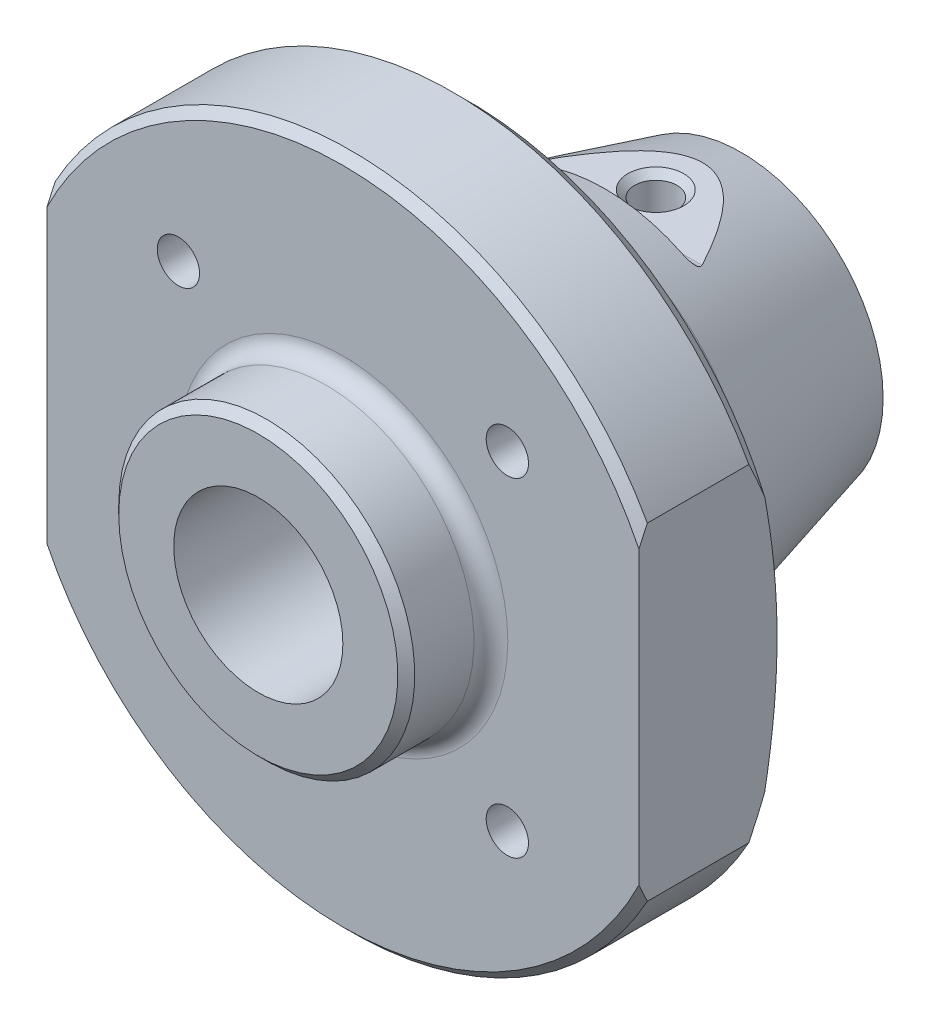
ISO-10303-21;
HEADER;
FILE_DESCRIPTION(('STEP AP214'),'2;1');
FILE_NAME('part.step','',(''),(''),'','','');
FILE_SCHEMA(('AUTOMOTIVE_DESIGN { 1 0 10303 214 1 1 1 1 }'));
ENDSEC;
DATA;
#1=APPLICATION_CONTEXT('core data for automotive mechanical design processes');
#2=APPLICATION_PROTOCOL_DEFINITION('international standard','automotive_design',2000,#1);
#3=PRODUCT_CONTEXT('',#1,'mechanical');
#4=PRODUCT('Part','Part','',(#3));
#5=PRODUCT_RELATED_PRODUCT_CATEGORY('part','',(#4));
#6=PRODUCT_DEFINITION_FORMATION('','',#4);
#7=PRODUCT_DEFINITION_CONTEXT('part definition',#1,'design');
#8=PRODUCT_DEFINITION('design','',#6,#7);
#9=PRODUCT_DEFINITION_SHAPE('','',#8);
#10=(LENGTH_UNIT() NAMED_UNIT(*) SI_UNIT(.MILLI.,.METRE.));
#11=(NAMED_UNIT(*) PLANE_ANGLE_UNIT() SI_UNIT($,.RADIAN.));
#12=(NAMED_UNIT(*) SI_UNIT($,.STERADIAN.) SOLID_ANGLE_UNIT());
#13=UNCERTAINTY_MEASURE_WITH_UNIT(LENGTH_MEASURE(1.E-05),#10,'distance_accuracy_value','');
#14=(GEOMETRIC_REPRESENTATION_CONTEXT(3) GLOBAL_UNCERTAINTY_ASSIGNED_CONTEXT((#13)) GLOBAL_UNIT_ASSIGNED_CONTEXT((#10,
#11,#12)) REPRESENTATION_CONTEXT('',''));
#15=CARTESIAN_POINT('',(0.,0.,0.));
#16=DIRECTION('',(0.,0.,1.));
#17=DIRECTION('',(1.,0.,0.));
#18=AXIS2_PLACEMENT_3D('',#15,#16,#17);
#19=CARTESIAN_POINT('',(40.,0.,-10.));
#20=DIRECTION('',(0.,0.,-1.));
#21=DIRECTION('',(-1.,0.,0.));
#22=AXIS2_PLACEMENT_3D('',#19,#20,#21);
#23=PLANE('',#22);
#24=CARTESIAN_POINT('',(0.,0.,-10.));
#25=DIRECTION('',(0.,0.,-1.));
#26=DIRECTION('',(-1.,0.,0.));
#27=AXIS2_PLACEMENT_3D('',#24,#25,#26);
#28=CIRCLE('',#27,19.5);
#29=CARTESIAN_POINT('',(-19.5,0.,-10.));
#30=VERTEX_POINT('',#29);
#31=EDGE_CURVE('E446',#30,#30,#28,.T.);
#32=ORIENTED_EDGE('',*,*,#31,.T.);
#33=EDGE_LOOP('',(#32));
#34=FACE_BOUND('',#33,.T.);
#35=DIRECTION('',(0.,-1.,0.));
#36=VECTOR('',#35,1.);
#37=CARTESIAN_POINT('',(-35.,45.,-10.));
#38=LINE('',#37,#36);
#39=CARTESIAN_POINT('',(-35.,17.2046505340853,-10.));
#40=VERTEX_POINT('',#39);
#41=CARTESIAN_POINT('',(-35.,-17.2046505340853,-10.));
#42=VERTEX_POINT('',#41);
#43=EDGE_CURVE('E371',#40,#42,#38,.T.);
#44=ORIENTED_EDGE('',*,*,#43,.T.);
#45=CARTESIAN_POINT('',(0.,0.,-10.));
#46=DIRECTION('',(0.,0.,-1.));
#47=DIRECTION('',(-1.,0.,0.));
#48=AXIS2_PLACEMENT_3D('',#45,#46,#47);
#49=CIRCLE('',#48,39.);
#50=CARTESIAN_POINT('',(35.,-17.2046505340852,-10.));
#51=VERTEX_POINT('',#50);
#52=EDGE_CURVE('E353',#42,#51,#49,.F.);
#53=ORIENTED_EDGE('',*,*,#52,.T.);
#54=DIRECTION('',(0.,1.,0.));
#55=VECTOR('',#54,1.);
#56=CARTESIAN_POINT('',(35.,45.,-10.));
#57=LINE('',#56,#55);
#58=CARTESIAN_POINT('',(35.,17.2046505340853,-10.));
#59=VERTEX_POINT('',#58);
#60=EDGE_CURVE('E366',#51,#59,#57,.T.);
#61=ORIENTED_EDGE('',*,*,#60,.T.);
#62=CARTESIAN_POINT('',(0.,0.,-10.));
#63=DIRECTION('',(0.,0.,-1.));
#64=DIRECTION('',(-1.,0.,0.));
#65=AXIS2_PLACEMENT_3D('',#62,#63,#64);
#66=CIRCLE('',#65,39.);
#67=EDGE_CURVE('E347',#59,#40,#66,.F.);
#68=ORIENTED_EDGE('',*,*,#67,.T.);
#69=EDGE_LOOP('',(#44,#53,#61,#68));
#70=FACE_BOUND('',#69,.T.);
#71=CARTESIAN_POINT('',(19.4454364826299,19.4454364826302,-10.));
#72=DIRECTION('',(0.,0.,1.));
#73=DIRECTION('',(1.,0.,0.));
#74=AXIS2_PLACEMENT_3D('',#71,#72,#73);
#75=CIRCLE('',#74,2.5);
#76=CARTESIAN_POINT('',(21.9454364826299,19.4454364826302,-10.));
#77=VERTEX_POINT('',#76);
#78=EDGE_CURVE('E501',#77,#77,#75,.T.);
#79=ORIENTED_EDGE('',*,*,#78,.F.);
#80=EDGE_LOOP('',(#79));
#81=FACE_BOUND('',#80,.T.);
#82=CARTESIAN_POINT('',(19.4454364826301,-19.44543648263,-10.));
#83=DIRECTION('',(0.,0.,1.));
#84=DIRECTION('',(1.,0.,0.));
#85=AXIS2_PLACEMENT_3D('',#82,#83,#84);
#86=CIRCLE('',#85,2.5);
#87=CARTESIAN_POINT('',(21.9454364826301,-19.44543648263,-10.));
#88=VERTEX_POINT('',#87);
#89=EDGE_CURVE('E495',#88,#88,#86,.T.);
#90=ORIENTED_EDGE('',*,*,#89,.F.);
#91=EDGE_LOOP('',(#90));
#92=FACE_BOUND('',#91,.T.);
#93=CARTESIAN_POINT('',(-19.4454364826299,-19.4454364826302,-10.));
#94=DIRECTION('',(0.,0.,1.));
#95=DIRECTION('',(1.,0.,0.));
#96=AXIS2_PLACEMENT_3D('',#93,#94,#95);
#97=CIRCLE('',#96,2.5);
#98=CARTESIAN_POINT('',(-16.9454364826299,-19.4454364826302,-10.));
#99=VERTEX_POINT('',#98);
#100=EDGE_CURVE('E488',#99,#99,#97,.T.);
#101=ORIENTED_EDGE('',*,*,#100,.F.);
#102=EDGE_LOOP('',(#101));
#103=FACE_BOUND('',#102,.T.);
#104=CARTESIAN_POINT('',(-19.44543648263,19.4454364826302,-10.));
#105=DIRECTION('',(0.,0.,1.));
#106=DIRECTION('',(1.,0.,0.));
#107=AXIS2_PLACEMENT_3D('',#104,#105,#106);
#108=CIRCLE('',#107,2.5);
#109=CARTESIAN_POINT('',(-16.94543648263,19.4454364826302,-10.));
#110=VERTEX_POINT('',#109);
#111=EDGE_CURVE('E479',#110,#110,#108,.T.);
#112=ORIENTED_EDGE('',*,*,#111,.F.);
#113=EDGE_LOOP('',(#112));
#114=FACE_BOUND('',#113,.T.);
#115=ADVANCED_FACE('F57',(#34,#70,#81,#92,#103,#114),#23,.F.);
#116=CARTESIAN_POINT('',(0.,0.,0.));
#117=DIRECTION('',(0.,0.,-1.));
#118=DIRECTION('',(-1.,0.,0.));
#119=AXIS2_PLACEMENT_3D('',#116,#117,#118);
#120=CYLINDRICAL_SURFACE('',#119,40.);
#121=DIRECTION('',(0.,0.,-1.));
#122=VECTOR('',#121,1.);
#123=CARTESIAN_POINT('',(35.,-19.3649167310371,0.));
#124=LINE('',#123,#122);
#125=CARTESIAN_POINT('',(35.,-19.3649167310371,-11.));
#126=VERTEX_POINT('',#125);
#127=CARTESIAN_POINT('',(35.,-19.3649167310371,-23.0000000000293));
#128=VERTEX_POINT('',#127);
#129=EDGE_CURVE('E408',#126,#128,#124,.T.);
#130=ORIENTED_EDGE('',*,*,#129,.F.);
#131=CARTESIAN_POINT('',(0.,0.,-11.));
#132=DIRECTION('',(0.,0.,-1.));
#133=DIRECTION('',(-1.,0.,0.));
#134=AXIS2_PLACEMENT_3D('',#131,#132,#133);
#135=CIRCLE('',#134,40.);
#136=CARTESIAN_POINT('',(-35.,-19.3649167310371,-11.));
#137=VERTEX_POINT('',#136);
#138=EDGE_CURVE('E378',#126,#137,#135,.T.);
#139=ORIENTED_EDGE('',*,*,#138,.T.);
#140=DIRECTION('',(0.,0.,-1.));
#141=VECTOR('',#140,1.);
#142=CARTESIAN_POINT('',(-35.,-19.3649167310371,0.));
#143=LINE('',#142,#141);
#144=CARTESIAN_POINT('',(-35.,-19.3649167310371,-23.0000000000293));
#145=VERTEX_POINT('',#144);
#146=EDGE_CURVE('E507',#145,#137,#143,.F.);
#147=ORIENTED_EDGE('',*,*,#146,.F.);
#148=CARTESIAN_POINT('',(0.,0.,-23.0000000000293));
#149=DIRECTION('',(0.,0.,1.));
#150=DIRECTION('',(1.,0.,0.));
#151=AXIS2_PLACEMENT_3D('',#148,#149,#150);
#152=CIRCLE('',#151,40.);
#153=EDGE_CURVE('E380',#145,#128,#152,.T.);
#154=ORIENTED_EDGE('',*,*,#153,.T.);
#155=EDGE_LOOP('',(#130,#139,#147,#154));
#156=FACE_BOUND('',#155,.T.);
#157=ADVANCED_FACE('F223',(#156),#120,.T.);
#158=DIRECTION('',(0.,0.,-1.));
#159=VECTOR('',#158,1.);
#160=CARTESIAN_POINT('',(35.,19.3649167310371,0.));
#161=LINE('',#160,#159);
#162=CARTESIAN_POINT('',(35.,19.3649167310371,-23.0000000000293));
#163=VERTEX_POINT('',#162);
#164=CARTESIAN_POINT('',(35.,19.3649167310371,-11.));
#165=VERTEX_POINT('',#164);
#166=EDGE_CURVE('E369',#163,#165,#161,.F.);
#167=ORIENTED_EDGE('',*,*,#166,.F.);
#168=CARTESIAN_POINT('',(0.,0.,-23.0000000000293));
#169=DIRECTION('',(0.,0.,1.));
#170=DIRECTION('',(1.,0.,0.));
#171=AXIS2_PLACEMENT_3D('',#168,#169,#170);
#172=CIRCLE('',#171,40.);
#173=CARTESIAN_POINT('',(-35.,19.3649167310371,-23.0000000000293));
#174=VERTEX_POINT('',#173);
#175=EDGE_CURVE('E434',#163,#174,#172,.T.);
#176=ORIENTED_EDGE('',*,*,#175,.T.);
#177=DIRECTION('',(0.,0.,-1.));
#178=VECTOR('',#177,1.);
#179=CARTESIAN_POINT('',(-35.,19.3649167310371,0.));
#180=LINE('',#179,#178);
#181=CARTESIAN_POINT('',(-35.,19.3649167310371,-11.));
#182=VERTEX_POINT('',#181);
#183=EDGE_CURVE('E509',#182,#174,#180,.T.);
#184=ORIENTED_EDGE('',*,*,#183,.F.);
#185=CARTESIAN_POINT('',(0.,0.,-11.));
#186=DIRECTION('',(0.,0.,-1.));
#187=DIRECTION('',(-1.,0.,0.));
#188=AXIS2_PLACEMENT_3D('',#185,#186,#187);
#189=CIRCLE('',#188,40.);
#190=EDGE_CURVE('E375',#182,#165,#189,.T.);
#191=ORIENTED_EDGE('',*,*,#190,.T.);
#192=EDGE_LOOP('',(#167,#176,#184,#191));
#193=FACE_BOUND('',#192,.T.);
#194=ADVANCED_FACE('F229',(#193),#120,.T.);
#195=CARTESIAN_POINT('',(0.,0.,-24.0000000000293));
#196=DIRECTION('',(0.,0.,1.));
#197=DIRECTION('',(1.,0.,0.));
#198=AXIS2_PLACEMENT_3D('',#195,#196,#197);
#199=CONICAL_SURFACE('',#198,40.,1.13446401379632);
#200=CARTESIAN_POINT('',(0.,0.,-29.6783194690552));
#201=DIRECTION('',(0.,0.,1.));
#202=DIRECTION('',(1.,0.,0.));
#203=AXIS2_PLACEMENT_3D('',#200,#201,#202);
#204=CIRCLE('',#203,27.8228046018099);
#205=CARTESIAN_POINT('',(27.8228046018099,0.,-29.6783194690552));
#206=VERTEX_POINT('',#205);
#207=EDGE_CURVE('E394',#206,#206,#204,.T.);
#208=ORIENTED_EDGE('',*,*,#207,.T.);
#209=EDGE_LOOP('',(#208));
#210=FACE_BOUND('',#209,.T.);
#211=CARTESIAN_POINT('',(35.,-52.7317049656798,-13.1396629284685));
#212=CARTESIAN_POINT('',(35.,-51.947402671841,-13.4443670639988));
#213=CARTESIAN_POINT('',(35.,-51.1624030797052,-13.747282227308));
#214=CARTESIAN_POINT('',(35.,-49.5908644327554,-14.3491133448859));
#215=CARTESIAN_POINT('',(35.,-48.8043253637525,-14.6480292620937));
#216=CARTESIAN_POINT('',(35.,-47.229471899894,-15.2414747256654));
#217=CARTESIAN_POINT('',(35.,-46.4411572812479,-15.5360036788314));
#218=CARTESIAN_POINT('',(35.,-44.8627063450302,-16.1201297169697));
#219=CARTESIAN_POINT('',(35.,-44.0725700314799,-16.4097268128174));
#220=CARTESIAN_POINT('',(35.,-41.6936723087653,-17.2723000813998));
#221=CARTESIAN_POINT('',(35.,-40.1018894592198,-17.8369895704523));
#222=CARTESIAN_POINT('',(35.,-36.9088382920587,-18.9387895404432));
#223=CARTESIAN_POINT('',(35.,-35.307570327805,-19.4759010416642));
#224=CARTESIAN_POINT('',(35.,-32.1240659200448,-20.5055619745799));
#225=CARTESIAN_POINT('',(35.,-30.5420407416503,-20.9987611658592));
#226=CARTESIAN_POINT('',(35.,-27.3652721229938,-21.9429957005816));
#227=CARTESIAN_POINT('',(35.,-25.7705280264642,-22.3940288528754));
#228=CARTESIAN_POINT('',(35.,-22.5684017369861,-23.2424841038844));
#229=CARTESIAN_POINT('',(35.,-20.9610335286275,-23.6399585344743));
#230=CARTESIAN_POINT('',(35.,-17.7312981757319,-24.368504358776));
#231=CARTESIAN_POINT('',(35.,-16.108933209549,-24.6995852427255));
#232=CARTESIAN_POINT('',(35.,-13.3662021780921,-25.1884912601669));
#233=CARTESIAN_POINT('',(35.,-12.2496958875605,-25.367971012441));
#234=CARTESIAN_POINT('',(35.,-10.01062978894,-25.6843773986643));
#235=CARTESIAN_POINT('',(35.,-8.88807013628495,-25.8213051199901));
#236=CARTESIAN_POINT('',(35.,-6.63882905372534,-26.0484156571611));
#237=CARTESIAN_POINT('',(35.,-5.51215031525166,-26.138624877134));
#238=CARTESIAN_POINT('',(35.,-3.25589214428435,-26.2693835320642));
#239=CARTESIAN_POINT('',(35.,-2.12631273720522,-26.3099334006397));
#240=CARTESIAN_POINT('',(35.,0.141741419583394,-26.3400277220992));
#241=CARTESIAN_POINT('',(35.,1.28022118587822,-26.3291995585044));
#242=CARTESIAN_POINT('',(35.,3.55554465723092,-26.2560809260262));
#243=CARTESIAN_POINT('',(35.,4.69238830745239,-26.1937887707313));
#244=CARTESIAN_POINT('',(35.,6.96256969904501,-26.0199356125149));
#245=CARTESIAN_POINT('',(35.,8.09590640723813,-25.908361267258));
#246=CARTESIAN_POINT('',(35.,10.3569632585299,-25.6396077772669));
#247=CARTESIAN_POINT('',(35.,11.4846840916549,-25.4824343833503));
#248=CARTESIAN_POINT('',(35.,13.6612149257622,-25.1384426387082));
#249=CARTESIAN_POINT('',(35.,14.7104334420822,-24.9541824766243));
#250=CARTESIAN_POINT('',(35.,16.8027903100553,-24.5536605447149));
#251=CARTESIAN_POINT('',(35.,17.8459281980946,-24.3373963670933));
#252=CARTESIAN_POINT('',(35.,19.9263987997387,-23.8767033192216));
#253=CARTESIAN_POINT('',(35.,20.9637288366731,-23.6322624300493));
#254=CARTESIAN_POINT('',(35.,23.032283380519,-23.1189729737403));
#255=CARTESIAN_POINT('',(35.,24.063508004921,-22.8501248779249));
#256=CARTESIAN_POINT('',(35.,26.1221273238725,-22.290810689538));
#257=CARTESIAN_POINT('',(35.,27.1495112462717,-22.0003051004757));
#258=CARTESIAN_POINT('',(35.,29.1989326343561,-21.4010515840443));
#259=CARTESIAN_POINT('',(35.,30.2209700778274,-21.0923035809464));
#260=CARTESIAN_POINT('',(35.,32.2599722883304,-20.4591603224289));
#261=CARTESIAN_POINT('',(35.,33.2769379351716,-20.1347678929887));
#262=CARTESIAN_POINT('',(35.,35.3064427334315,-19.4724553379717));
#263=CARTESIAN_POINT('',(35.,36.3189818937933,-19.1345352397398));
#264=CARTESIAN_POINT('',(35.,38.3485534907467,-18.4441303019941));
#265=CARTESIAN_POINT('',(35.,39.3655524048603,-18.0915470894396));
#266=CARTESIAN_POINT('',(35.,41.395924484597,-17.3761062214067));
#267=CARTESIAN_POINT('',(35.,42.4092976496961,-17.0132485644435));
#268=CARTESIAN_POINT('',(35.,44.4328240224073,-16.2786083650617));
#269=CARTESIAN_POINT('',(35.,45.4429771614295,-15.9068256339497));
#270=CARTESIAN_POINT('',(35.,47.4603868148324,-15.1554919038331));
#271=CARTESIAN_POINT('',(35.,48.4676433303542,-14.7759409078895));
#272=CARTESIAN_POINT('',(35.,50.4785152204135,-14.0104478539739));
#273=CARTESIAN_POINT('',(35.,51.4821333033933,-13.624512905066));
#274=CARTESIAN_POINT('',(35.,53.4870597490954,-12.8466860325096));
#275=CARTESIAN_POINT('',(35.,54.4883681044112,-12.4547940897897));
#276=CARTESIAN_POINT('',(35.,57.4891631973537,-11.2712835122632));
#277=CARTESIAN_POINT('',(35.,59.4855560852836,-10.4718163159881));
#278=CARTESIAN_POINT('',(35.,63.4436402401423,-8.86783468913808));
#279=CARTESIAN_POINT('',(35.,65.4054246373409,-8.06354941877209));
#280=CARTESIAN_POINT('',(35.,69.3237050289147,-6.44220190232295));
#281=CARTESIAN_POINT('',(35.,71.2802010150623,-5.62513963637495));
#282=CARTESIAN_POINT('',(35.,75.1894154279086,-3.98041925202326));
#283=CARTESIAN_POINT('',(35.,77.1421325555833,-3.1527580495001));
#284=CARTESIAN_POINT('',(35.,81.043939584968,-1.48894093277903));
#285=CARTESIAN_POINT('',(35.,82.9930294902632,-0.652785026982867));
#286=CARTESIAN_POINT('',(35.,86.8548495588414,1.01220409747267));
#287=CARTESIAN_POINT('',(35.,88.767631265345,1.84091784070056));
#288=CARTESIAN_POINT('',(35.,92.5907078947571,3.50406320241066));
#289=CARTESIAN_POINT('',(35.,94.501002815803,4.33849482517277));
#290=CARTESIAN_POINT('',(35.,98.3188038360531,6.01190196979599));
#291=CARTESIAN_POINT('',(35.,100.22631067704,6.85087580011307));
#292=CARTESIAN_POINT('',(35.,104.039485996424,8.53297531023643));
#293=CARTESIAN_POINT('',(35.,105.945154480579,9.37610097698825));
#294=CARTESIAN_POINT('',(35.,107.850050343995,10.2209645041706));
#295=B_SPLINE_CURVE_WITH_KNOTS('',3,(#211,#212,#213,#214,#215,#216,#217,#218,#219,#220,#221,
#222,#223,#224,#225,#226,#227,#228,#229,#230,#231,#232,#233,#234,#235,#236,#237,#238,#239,#240,
#241,#242,#243,#244,#245,#246,#247,#248,#249,#250,#251,#252,#253,#254,#255,#256,#257,#258,#259,
#260,#261,#262,#263,#264,#265,#266,#267,#268,#269,#270,#271,#272,#273,#274,#275,#276,#277,#278,
#279,#280,#281,#282,#283,#284,#285,#286,#287,#288,#289,#290,#291,#292,#293,#294),.UNSPECIFIED.,
.F.,.F.,(4,2,2,2,2,2,2,2,2,2,2,2,2,2,2,2,2,2,2,2,2,2,2,2,2,2,2,2,2,2,2,2,2,2,2,2,2,2,2,2,2,4),
(0.,2.52423777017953,5.04849891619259,7.57309834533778,10.0976922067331,15.1644154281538,
20.2309510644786,25.2018548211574,30.1730167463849,35.1392856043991,40.1048440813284,
43.4966639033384,46.8883970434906,50.2782111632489,53.6679956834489,57.0824018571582,
60.4969199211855,63.9123629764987,67.3273754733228,70.522652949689,73.7181709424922,
76.9150570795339,80.1118814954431,83.3146856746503,86.5175031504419,89.7197442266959,
92.9219788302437,96.1510664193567,99.3801544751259,102.609310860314,105.838465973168,
109.064239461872,112.290023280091,118.741474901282,125.102182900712,131.462900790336,
137.82551361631,144.188120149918,150.441868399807,156.695621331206,162.947186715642,
169.198732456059),.UNSPECIFIED.);
#296=CARTESIAN_POINT('',(35.,-15.1199140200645,-24.8737387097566));
#297=VERTEX_POINT('',#296);
#298=CARTESIAN_POINT('',(35.,15.1199140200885,-24.8737387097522));
#299=VERTEX_POINT('',#298);
#300=EDGE_CURVE('E296',#297,#299,#295,.T.);
#301=ORIENTED_EDGE('',*,*,#300,.F.);
#302=CARTESIAN_POINT('',(0.,0.,-24.8737387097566));
#303=DIRECTION('',(0.,0.,-1.));
#304=DIRECTION('',(-1.,0.,0.));
#305=AXIS2_PLACEMENT_3D('',#302,#303,#304);
#306=CIRCLE('',#305,38.1262612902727);
#307=CARTESIAN_POINT('',(-35.,-15.1199140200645,-24.8737387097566));
#308=VERTEX_POINT('',#307);
#309=EDGE_CURVE('E429',#297,#308,#306,.T.);
#310=ORIENTED_EDGE('',*,*,#309,.T.);
#311=CARTESIAN_POINT('',(-35.,-52.7317049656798,-13.1396629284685));
#312=CARTESIAN_POINT('',(-35.,-51.947402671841,-13.4443670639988));
#313=CARTESIAN_POINT('',(-35.,-51.1624030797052,-13.747282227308));
#314=CARTESIAN_POINT('',(-35.,-49.5908644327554,-14.3491133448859));
#315=CARTESIAN_POINT('',(-35.,-48.8043253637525,-14.6480292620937));
#316=CARTESIAN_POINT('',(-35.,-47.229471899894,-15.2414747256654));
#317=CARTESIAN_POINT('',(-35.,-46.4411572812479,-15.5360036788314));
#318=CARTESIAN_POINT('',(-35.,-44.8627063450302,-16.1201297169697));
#319=CARTESIAN_POINT('',(-35.,-44.0725700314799,-16.4097268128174));
#320=CARTESIAN_POINT('',(-35.,-41.6936723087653,-17.2723000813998));
#321=CARTESIAN_POINT('',(-35.,-40.1018894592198,-17.8369895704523));
#322=CARTESIAN_POINT('',(-35.,-36.9088382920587,-18.9387895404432));
#323=CARTESIAN_POINT('',(-35.,-35.3075703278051,-19.4759010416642));
#324=CARTESIAN_POINT('',(-35.,-32.1240659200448,-20.5055619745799));
#325=CARTESIAN_POINT('',(-35.,-30.5420407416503,-20.9987611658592));
#326=CARTESIAN_POINT('',(-35.,-27.3652721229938,-21.9429957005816));
#327=CARTESIAN_POINT('',(-35.,-25.7705280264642,-22.3940288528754));
#328=CARTESIAN_POINT('',(-35.,-22.5684017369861,-23.2424841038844));
#329=CARTESIAN_POINT('',(-35.,-20.9610335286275,-23.6399585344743));
#330=CARTESIAN_POINT('',(-35.,-17.7312981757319,-24.368504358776));
#331=CARTESIAN_POINT('',(-35.,-16.108933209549,-24.6995852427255));
#332=CARTESIAN_POINT('',(-35.,-13.3662021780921,-25.1884912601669));
#333=CARTESIAN_POINT('',(-35.,-12.2496958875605,-25.367971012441));
#334=CARTESIAN_POINT('',(-35.,-10.01062978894,-25.6843773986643));
#335=CARTESIAN_POINT('',(-35.,-8.88807013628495,-25.8213051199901));
#336=CARTESIAN_POINT('',(-35.,-6.63882905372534,-26.0484156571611));
#337=CARTESIAN_POINT('',(-35.,-5.51215031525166,-26.138624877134));
#338=CARTESIAN_POINT('',(-35.,-3.25589214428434,-26.2693835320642));
#339=CARTESIAN_POINT('',(-35.,-2.12631273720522,-26.3099334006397));
#340=CARTESIAN_POINT('',(-35.,0.141741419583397,-26.3400277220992));
#341=CARTESIAN_POINT('',(-35.,1.28022118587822,-26.3291995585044));
#342=CARTESIAN_POINT('',(-35.,3.55554465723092,-26.2560809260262));
#343=CARTESIAN_POINT('',(-35.,4.69238830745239,-26.1937887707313));
#344=CARTESIAN_POINT('',(-35.,6.96256969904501,-26.0199356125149));
#345=CARTESIAN_POINT('',(-35.,8.09590640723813,-25.908361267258));
#346=CARTESIAN_POINT('',(-35.,10.3569632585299,-25.6396077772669));
#347=CARTESIAN_POINT('',(-35.,11.4846840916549,-25.4824343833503));
#348=CARTESIAN_POINT('',(-35.,13.6612149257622,-25.1384426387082));
#349=CARTESIAN_POINT('',(-35.,14.7104334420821,-24.9541824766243));
#350=CARTESIAN_POINT('',(-35.,16.8027903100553,-24.5536605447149));
#351=CARTESIAN_POINT('',(-35.,17.8459281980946,-24.3373963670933));
#352=CARTESIAN_POINT('',(-35.,19.9263987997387,-23.8767033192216));
#353=CARTESIAN_POINT('',(-35.,20.9637288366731,-23.6322624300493));
#354=CARTESIAN_POINT('',(-35.,23.0322833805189,-23.1189729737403));
#355=CARTESIAN_POINT('',(-35.,24.063508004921,-22.8501248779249));
#356=CARTESIAN_POINT('',(-35.,26.1221273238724,-22.290810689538));
#357=CARTESIAN_POINT('',(-35.,27.1495112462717,-22.0003051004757));
#358=CARTESIAN_POINT('',(-35.,29.1989326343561,-21.4010515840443));
#359=CARTESIAN_POINT('',(-35.,30.2209700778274,-21.0923035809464));
#360=CARTESIAN_POINT('',(-35.,32.2599722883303,-20.4591603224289));
#361=CARTESIAN_POINT('',(-35.,33.2769379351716,-20.1347678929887));
#362=CARTESIAN_POINT('',(-35.,35.3064427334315,-19.4724553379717));
#363=CARTESIAN_POINT('',(-35.,36.3189818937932,-19.1345352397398));
#364=CARTESIAN_POINT('',(-35.,38.3485534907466,-18.4441303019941));
#365=CARTESIAN_POINT('',(-35.,39.3655524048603,-18.0915470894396));
#366=CARTESIAN_POINT('',(-35.,41.395924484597,-17.3761062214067));
#367=CARTESIAN_POINT('',(-35.,42.409297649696,-17.0132485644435));
#368=CARTESIAN_POINT('',(-35.,44.4328240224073,-16.2786083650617));
#369=CARTESIAN_POINT('',(-35.,45.4429771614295,-15.9068256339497));
#370=CARTESIAN_POINT('',(-35.,47.4603868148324,-15.1554919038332));
#371=CARTESIAN_POINT('',(-35.,48.4676433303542,-14.7759409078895));
#372=CARTESIAN_POINT('',(-35.,50.4785152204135,-14.0104478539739));
#373=CARTESIAN_POINT('',(-35.,51.4821333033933,-13.624512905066));
#374=CARTESIAN_POINT('',(-35.,53.4870597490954,-12.8466860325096));
#375=CARTESIAN_POINT('',(-35.,54.4883681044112,-12.4547940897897));
#376=CARTESIAN_POINT('',(-35.,57.4891631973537,-11.2712835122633));
#377=CARTESIAN_POINT('',(-35.,59.4855560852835,-10.4718163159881));
#378=CARTESIAN_POINT('',(-35.,63.4436402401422,-8.86783468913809));
#379=CARTESIAN_POINT('',(-35.,65.4054246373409,-8.06354941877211));
#380=CARTESIAN_POINT('',(-35.,69.3237050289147,-6.44220190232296));
#381=CARTESIAN_POINT('',(-35.,71.2802010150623,-5.62513963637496));
#382=CARTESIAN_POINT('',(-35.,75.1894154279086,-3.98041925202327));
#383=CARTESIAN_POINT('',(-35.,77.1421325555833,-3.1527580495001));
#384=CARTESIAN_POINT('',(-35.,81.043939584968,-1.48894093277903));
#385=CARTESIAN_POINT('',(-35.,82.9930294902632,-0.652785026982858));
#386=CARTESIAN_POINT('',(-35.,86.8548495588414,1.01220409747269));
#387=CARTESIAN_POINT('',(-35.,88.767631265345,1.84091784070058));
#388=CARTESIAN_POINT('',(-35.,92.5907078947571,3.50406320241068));
#389=CARTESIAN_POINT('',(-35.,94.501002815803,4.3384948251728));
#390=CARTESIAN_POINT('',(-35.,98.3188038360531,6.01190196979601));
#391=CARTESIAN_POINT('',(-35.,100.22631067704,6.85087580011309));
#392=CARTESIAN_POINT('',(-35.,104.039485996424,8.53297531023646));
#393=CARTESIAN_POINT('',(-35.,105.945154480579,9.37610097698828));
#394=CARTESIAN_POINT('',(-35.,107.850050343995,10.2209645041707));
#395=B_SPLINE_CURVE_WITH_KNOTS('',3,(#311,#312,#313,#314,#315,#316,#317,#318,#319,#320,#321,
#322,#323,#324,#325,#326,#327,#328,#329,#330,#331,#332,#333,#334,#335,#336,#337,#338,#339,#340,
#341,#342,#343,#344,#345,#346,#347,#348,#349,#350,#351,#352,#353,#354,#355,#356,#357,#358,#359,
#360,#361,#362,#363,#364,#365,#366,#367,#368,#369,#370,#371,#372,#373,#374,#375,#376,#377,#378,
#379,#380,#381,#382,#383,#384,#385,#386,#387,#388,#389,#390,#391,#392,#393,#394),.UNSPECIFIED.,
.F.,.F.,(4,2,2,2,2,2,2,2,2,2,2,2,2,2,2,2,2,2,2,2,2,2,2,2,2,2,2,2,2,2,2,2,2,2,2,2,2,2,2,2,2,4),
(0.,2.52423777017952,5.04849891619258,7.57309834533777,10.0976922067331,15.1644154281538,
20.2309510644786,25.2018548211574,30.1730167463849,35.1392856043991,40.1048440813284,
43.4966639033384,46.8883970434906,50.2782111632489,53.6679956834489,57.0824018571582,
60.4969199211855,63.9123629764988,67.3273754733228,70.522652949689,73.7181709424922,
76.9150570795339,80.1118814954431,83.3146856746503,86.5175031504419,89.7197442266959,
92.9219788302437,96.1510664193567,99.3801544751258,102.609310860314,105.838465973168,
109.064239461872,112.290023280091,118.741474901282,125.102182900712,131.462900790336,
137.82551361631,144.188120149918,150.441868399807,156.695621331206,162.947186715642,
169.198732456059),.UNSPECIFIED.);
#396=CARTESIAN_POINT('',(-35.,15.1199140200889,-24.8737387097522));
#397=VERTEX_POINT('',#396);
#398=EDGE_CURVE('E403',#397,#308,#395,.F.);
#399=ORIENTED_EDGE('',*,*,#398,.F.);
#400=CARTESIAN_POINT('',(0.,0.,-24.8737387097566));
#401=DIRECTION('',(0.,0.,-1.));
#402=DIRECTION('',(-1.,0.,0.));
#403=AXIS2_PLACEMENT_3D('',#400,#401,#402);
#404=CIRCLE('',#403,38.1262612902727);
#405=EDGE_CURVE('E277',#397,#299,#404,.T.);
#406=ORIENTED_EDGE('',*,*,#405,.T.);
#407=EDGE_LOOP('',(#301,#310,#399,#406));
#408=FACE_BOUND('',#407,.T.);
#409=ADVANCED_FACE('F242',(#210,#408),#199,.T.);
#410=CARTESIAN_POINT('',(0.,0.,0.));
#411=DIRECTION('',(0.,0.,-1.));
#412=DIRECTION('',(-1.,0.,0.));
#413=AXIS2_PLACEMENT_3D('',#410,#411,#412);
#414=PLANE('',#413);
#415=CARTESIAN_POINT('',(0.,0.,0.));
#416=DIRECTION('',(0.,0.,-1.));
#417=DIRECTION('',(-1.,0.,0.));
#418=AXIS2_PLACEMENT_3D('',#415,#416,#417);
#419=CIRCLE('',#418,16.5);
#420=CARTESIAN_POINT('',(-16.5,0.,0.));
#421=VERTEX_POINT('',#420);
#422=EDGE_CURVE('E443',#421,#421,#419,.F.);
#423=ORIENTED_EDGE('',*,*,#422,.T.);
#424=EDGE_LOOP('',(#423));
#425=FACE_BOUND('',#424,.T.);
#426=CARTESIAN_POINT('',(0.,0.,0.));
#427=DIRECTION('',(0.,0.,1.));
#428=DIRECTION('',(1.,0.,0.));
#429=AXIS2_PLACEMENT_3D('',#426,#427,#428);
#430=CIRCLE('',#429,10.);
#431=CARTESIAN_POINT('',(10.,0.,0.));
#432=VERTEX_POINT('',#431);
#433=EDGE_CURVE('E470',#432,#432,#430,.T.);
#434=ORIENTED_EDGE('',*,*,#433,.F.);
#435=EDGE_LOOP('',(#434));
#436=FACE_BOUND('',#435,.T.);
#437=ADVANCED_FACE('F238',(#425,#436),#414,.F.);
#438=CARTESIAN_POINT('',(0.,0.,0.));
#439=DIRECTION('',(0.,0.,-1.));
#440=DIRECTION('',(-1.,0.,0.));
#441=AXIS2_PLACEMENT_3D('',#438,#439,#440);
#442=CYLINDRICAL_SURFACE('',#441,17.5);
#443=CARTESIAN_POINT('',(0.,0.,-8.));
#444=DIRECTION('',(0.,0.,-1.));
#445=DIRECTION('',(-1.,0.,0.));
#446=AXIS2_PLACEMENT_3D('',#443,#444,#445);
#447=CIRCLE('',#446,17.5);
#448=CARTESIAN_POINT('',(-17.5,0.,-8.));
#449=VERTEX_POINT('',#448);
#450=EDGE_CURVE('E163',#449,#449,#447,.F.);
#451=ORIENTED_EDGE('',*,*,#450,.T.);
#452=EDGE_LOOP('',(#451));
#453=FACE_BOUND('',#452,.T.);
#454=CARTESIAN_POINT('',(0.,0.,-0.999999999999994));
#455=DIRECTION('',(0.,0.,-1.));
#456=DIRECTION('',(-1.,0.,0.));
#457=AXIS2_PLACEMENT_3D('',#454,#455,#456);
#458=CIRCLE('',#457,17.5);
#459=CARTESIAN_POINT('',(-17.5,0.,-0.999999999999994));
#460=VERTEX_POINT('',#459);
#461=EDGE_CURVE('E439',#460,#460,#458,.T.);
#462=ORIENTED_EDGE('',*,*,#461,.T.);
#463=EDGE_LOOP('',(#462));
#464=FACE_BOUND('',#463,.T.);
#465=ADVANCED_FACE('F235',(#453,#464),#442,.T.);
#466=CARTESIAN_POINT('',(0.,0.,-31.6490207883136));
#467=DIRECTION('',(0.,0.,1.));
#468=DIRECTION('',(1.,0.,0.));
#469=AXIS2_PLACEMENT_3D('',#466,#467,#468);
#470=CONICAL_SURFACE('',#469,23.5966219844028,0.261799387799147);
#471=CARTESIAN_POINT('',(-9.15555255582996,19.0002000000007,-41.0000000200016));
#472=CARTESIAN_POINT('',(-9.19264052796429,18.9823291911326,-40.9999980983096));
#473=CARTESIAN_POINT('',(-9.2296200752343,18.9642352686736,-41.0004716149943));
#474=CARTESIAN_POINT('',(-9.30333308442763,18.927590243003,-41.0024559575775));
#475=CARTESIAN_POINT('',(-9.34006649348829,18.9090390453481,-41.0039669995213));
#476=CARTESIAN_POINT('',(-9.45024323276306,18.8524825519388,-41.0102092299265));
#477=CARTESIAN_POINT('',(-9.52324378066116,18.8137757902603,-41.0166515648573));
#478=CARTESIAN_POINT('',(-9.6707137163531,18.7327518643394,-41.0354351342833));
#479=CARTESIAN_POINT('',(-9.74510713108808,18.6903508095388,-41.0480226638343));
#480=CARTESIAN_POINT('',(-9.89090645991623,18.6036822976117,-41.0807182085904));
#481=CARTESIAN_POINT('',(-9.96231974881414,18.5594200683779,-41.1008062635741));
#482=CARTESIAN_POINT('',(-10.0900723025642,18.4760906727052,-41.1471030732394));
#483=CARTESIAN_POINT('',(-10.147048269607,18.4372622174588,-41.1719089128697));
#484=CARTESIAN_POINT('',(-10.2281949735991,18.3787581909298,-41.2160079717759));
#485=CARTESIAN_POINT('',(-10.2544278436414,18.3592917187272,-41.2317793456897));
#486=CARTESIAN_POINT('',(-10.3051040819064,18.3203825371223,-41.2659756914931));
#487=CARTESIAN_POINT('',(-10.3295490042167,18.3009398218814,-41.2843983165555));
#488=CARTESIAN_POINT('',(-10.3767592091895,18.2617397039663,-41.3248786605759));
#489=CARTESIAN_POINT('',(-10.399454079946,18.2419898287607,-41.3470272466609));
#490=CARTESIAN_POINT('',(-10.441410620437,18.2031972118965,-41.3949756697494));
#491=CARTESIAN_POINT('',(-10.4606731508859,18.184154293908,-41.4207745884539));
#492=CARTESIAN_POINT('',(-10.4918799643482,18.1503279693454,-41.471941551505));
#493=CARTESIAN_POINT('',(-10.5044954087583,18.135341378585,-41.4967587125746));
#494=CARTESIAN_POINT('',(-10.5254737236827,18.1069868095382,-41.5489929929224));
#495=CARTESIAN_POINT('',(-10.5338410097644,18.0936171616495,-41.5764073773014));
#496=CARTESIAN_POINT('',(-10.5455960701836,18.0690521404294,-41.6335192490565));
#497=CARTESIAN_POINT('',(-10.5489422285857,18.0578755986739,-41.6632336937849));
#498=CARTESIAN_POINT('',(-10.5501475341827,18.0384050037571,-41.7236982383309));
#499=CARTESIAN_POINT('',(-10.5480080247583,18.030110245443,-41.7544480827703));
#500=CARTESIAN_POINT('',(-10.5391438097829,18.0174767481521,-41.8118485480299));
#501=CARTESIAN_POINT('',(-10.5330421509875,18.0127671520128,-41.8385192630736));
#502=CARTESIAN_POINT('',(-10.5173884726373,18.0055908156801,-41.8911201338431));
#503=CARTESIAN_POINT('',(-10.507835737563,18.003124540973,-41.9170501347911));
#504=CARTESIAN_POINT('',(-10.4883583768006,18.0005255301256,-41.9620446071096));
#505=CARTESIAN_POINT('',(-10.4790066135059,17.9999911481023,-41.9813353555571));
#506=CARTESIAN_POINT('',(-10.4689376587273,18.0000000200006,-42.0002000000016));
#507=B_SPLINE_CURVE_WITH_KNOTS('',3,(#471,#472,#473,#474,#475,#476,#477,#478,#479,#480,#481,
#482,#483,#484,#485,#486,#487,#488,#489,#490,#491,#492,#493,#494,#495,#496,#497,#498,#499,#500,
#501,#502,#503,#504,#505,#506),.UNSPECIFIED.,.F.,.F.,(4,2,2,2,2,2,2,2,2,2,2,2,2,2,2,2,2,4),(0.,
0.123500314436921,0.247026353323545,0.495471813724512,0.754812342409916,1.01346758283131,
1.23262859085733,1.34134228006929,1.44996032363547,1.56176829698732,1.67354819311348,
1.76803400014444,1.86242139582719,1.95758685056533,2.05272900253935,2.13567279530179,
2.21863379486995,2.28282970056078),.UNSPECIFIED.);
#508=CARTESIAN_POINT('',(-9.15596760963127,19.0000000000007,-41.0000000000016));
#509=VERTEX_POINT('',#508);
#510=CARTESIAN_POINT('',(-10.4690442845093,18.0000000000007,-42.0000000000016));
#511=VERTEX_POINT('',#510);
#512=EDGE_CURVE('E169',#509,#511,#507,.T.);
#513=ORIENTED_EDGE('',*,*,#512,.T.);
#514=CARTESIAN_POINT('',(-22.3234689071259,18.0000000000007,-12.690943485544));
#515=CARTESIAN_POINT('',(-22.1072563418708,18.0000000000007,-13.3190865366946));
#516=CARTESIAN_POINT('',(-21.8899438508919,18.0000000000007,-13.9468506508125));
#517=CARTESIAN_POINT('',(-21.4529092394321,18.0000000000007,-15.201542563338));
#518=CARTESIAN_POINT('',(-21.2331871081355,18.0000000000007,-15.8284703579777));
#519=CARTESIAN_POINT('',(-20.5700413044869,18.0000000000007,-17.7080239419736));
#520=CARTESIAN_POINT('',(-20.1226901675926,18.0000000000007,-18.9592686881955));
#521=CARTESIAN_POINT('',(-19.2131040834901,18.0000000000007,-21.4635285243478));
#522=CARTESIAN_POINT('',(-18.750805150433,18.0000000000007,-22.7165204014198));
#523=CARTESIAN_POINT('',(-17.8106943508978,18.0000000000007,-25.2165912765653));
#524=CARTESIAN_POINT('',(-17.3328836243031,18.0000000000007,-26.4636707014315));
#525=CARTESIAN_POINT('',(-16.5879168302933,18.0000000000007,-28.363382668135));
#526=CARTESIAN_POINT('',(-16.3277786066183,18.0000000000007,-29.0187690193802));
#527=CARTESIAN_POINT('',(-15.8013136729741,18.0000000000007,-30.3270492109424));
#528=CARTESIAN_POINT('',(-15.5349870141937,18.0000000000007,-30.9799430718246));
#529=CARTESIAN_POINT('',(-14.9951814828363,18.0000000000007,-32.2829543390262));
#530=CARTESIAN_POINT('',(-14.7217009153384,18.0000000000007,-32.9330710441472));
#531=CARTESIAN_POINT('',(-14.1665375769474,18.0000000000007,-34.2297923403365));
#532=CARTESIAN_POINT('',(-13.8848548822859,18.0000000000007,-34.8763969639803));
#533=CARTESIAN_POINT('',(-13.3125657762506,18.0000000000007,-36.1638405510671));
#534=CARTESIAN_POINT('',(-13.0219818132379,18.0000000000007,-36.8046894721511));
#535=CARTESIAN_POINT('',(-12.4294948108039,18.0000000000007,-38.0811833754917));
#536=CARTESIAN_POINT('',(-12.1275912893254,18.0000000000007,-38.716828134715));
#537=CARTESIAN_POINT('',(-11.510324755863,18.0000000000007,-39.981233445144));
#538=CARTESIAN_POINT('',(-11.1949674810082,18.0000000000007,-40.6099967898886));
#539=CARTESIAN_POINT('',(-10.5476864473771,18.0000000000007,-41.858909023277));
#540=CARTESIAN_POINT('',(-10.2157647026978,18.0000000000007,-42.4790589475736));
#541=CARTESIAN_POINT('',(-9.71656830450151,18.0000000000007,-43.3750027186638));
#542=CARTESIAN_POINT('',(-9.55749396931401,18.0000000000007,-43.6553734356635));
#543=CARTESIAN_POINT('',(-9.23444350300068,18.0000000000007,-44.2132859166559));
#544=CARTESIAN_POINT('',(-9.07046733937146,18.0000000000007,-44.4908276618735));
#545=CARTESIAN_POINT('',(-8.73690874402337,18.0000000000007,-45.0427655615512));
#546=CARTESIAN_POINT('',(-8.56732285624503,18.0000000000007,-45.317159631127));
#547=CARTESIAN_POINT('',(-8.22191332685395,18.0000000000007,-45.8620101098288));
#548=CARTESIAN_POINT('',(-8.04608956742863,18.0000000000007,-46.132466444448));
#549=CARTESIAN_POINT('',(-7.68753696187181,18.0000000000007,-46.6683444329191));
#550=CARTESIAN_POINT('',(-7.50481594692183,18.0000000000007,-46.9337713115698));
#551=CARTESIAN_POINT('',(-7.131253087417,18.0000000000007,-47.4588420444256));
#552=CARTESIAN_POINT('',(-6.94041177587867,18.0000000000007,-47.7184862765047));
#553=CARTESIAN_POINT('',(-6.54953784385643,18.0000000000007,-48.2303530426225));
#554=CARTESIAN_POINT('',(-6.34951530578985,18.0000000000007,-48.4825832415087));
#555=CARTESIAN_POINT('',(-5.93850497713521,18.0000000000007,-48.9780941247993));
#556=CARTESIAN_POINT('',(-5.72751468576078,18.0000000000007,-49.2213727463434));
#557=CARTESIAN_POINT('',(-5.28944028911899,18.0000000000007,-49.6999357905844));
#558=CARTESIAN_POINT('',(-5.06216000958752,18.0000000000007,-49.9350420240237));
#559=CARTESIAN_POINT('',(-4.59227616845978,18.0000000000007,-50.3892780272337));
#560=CARTESIAN_POINT('',(-4.34968201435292,18.0000000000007,-50.6084174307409));
#561=CARTESIAN_POINT('',(-3.84817515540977,18.0000000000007,-51.023905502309));
#562=CARTESIAN_POINT('',(-3.5893813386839,18.0000000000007,-51.2203956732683));
#563=CARTESIAN_POINT('',(-3.05225246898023,18.0000000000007,-51.5840658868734));
#564=CARTESIAN_POINT('',(-2.77395097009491,18.0000000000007,-51.7512946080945));
#565=CARTESIAN_POINT('',(-2.21788690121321,18.0000000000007,-52.0350540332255));
#566=CARTESIAN_POINT('',(-1.94162146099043,18.0000000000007,-52.1544289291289));
#567=CARTESIAN_POINT('',(-1.5159264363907,18.0000000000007,-52.3001562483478));
#568=CARTESIAN_POINT('',(-1.37212860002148,18.0000000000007,-52.3431791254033));
#569=CARTESIAN_POINT('',(-1.08144209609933,18.0000000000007,-52.4169377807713));
#570=CARTESIAN_POINT('',(-0.934554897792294,18.0000000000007,-52.4476792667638));
#571=CARTESIAN_POINT('',(-0.637335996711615,18.0000000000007,-52.4961049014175));
#572=CARTESIAN_POINT('',(-0.486985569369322,18.0000000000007,-52.5136749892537));
#573=CARTESIAN_POINT('',(-0.185295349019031,18.0000000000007,-52.5346968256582));
#574=CARTESIAN_POINT('',(-0.0339555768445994,18.0000000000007,-52.5381488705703));
#575=CARTESIAN_POINT('',(0.268402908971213,18.0000000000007,-52.5307988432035));
#576=CARTESIAN_POINT('',(0.419421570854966,18.0000000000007,-52.519994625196));
#577=CARTESIAN_POINT('',(0.719845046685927,18.0000000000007,-52.484542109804));
#578=CARTESIAN_POINT('',(0.869249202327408,18.0000000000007,-52.4598883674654));
#579=CARTESIAN_POINT('',(1.28632007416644,18.0000000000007,-52.3720223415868));
#580=CARTESIAN_POINT('',(1.55090235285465,18.0000000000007,-52.2937635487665));
#581=CARTESIAN_POINT('',(2.06628981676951,18.0000000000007,-52.1015357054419));
#582=CARTESIAN_POINT('',(2.31709501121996,18.0000000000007,-51.987566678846));
#583=CARTESIAN_POINT('',(2.78554687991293,18.0000000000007,-51.7413575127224));
#584=CARTESIAN_POINT('',(3.00426969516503,18.0000000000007,-51.6111285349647));
#585=CARTESIAN_POINT('',(3.42951699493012,18.0000000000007,-51.3319342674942));
#586=CARTESIAN_POINT('',(3.63603143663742,18.0000000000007,-51.1829538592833));
#587=CARTESIAN_POINT('',(4.03846491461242,18.0000000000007,-50.8698463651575));
#588=CARTESIAN_POINT('',(4.23433800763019,18.0000000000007,-50.7056607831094));
#589=CARTESIAN_POINT('',(4.61571675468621,18.0000000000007,-50.3658665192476));
#590=CARTESIAN_POINT('',(4.80122557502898,18.0000000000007,-50.1902613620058));
#591=CARTESIAN_POINT('',(5.25244536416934,18.0000000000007,-49.7410699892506));
#592=CARTESIAN_POINT('',(5.51257176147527,18.0000000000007,-49.4618864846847));
#593=CARTESIAN_POINT('',(6.01610909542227,18.0000000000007,-48.8887394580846));
#594=CARTESIAN_POINT('',(6.25951051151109,18.0000000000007,-48.594767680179));
#595=CARTESIAN_POINT('',(6.73272924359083,18.0000000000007,-47.9952592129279));
#596=CARTESIAN_POINT('',(6.96252046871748,18.0000000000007,-47.6897020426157));
#597=CARTESIAN_POINT('',(7.41030766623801,18.0000000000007,-47.0700522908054));
#598=CARTESIAN_POINT('',(7.62830212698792,18.0000000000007,-46.7559586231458));
#599=CARTESIAN_POINT('',(8.05671491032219,18.0000000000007,-46.1174085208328));
#600=CARTESIAN_POINT('',(8.26701695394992,18.0000000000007,-45.7928743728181));
#601=CARTESIAN_POINT('',(8.67884743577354,18.0000000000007,-45.138285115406));
#602=CARTESIAN_POINT('',(8.88037548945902,18.0000000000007,-44.8082297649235));
#603=CARTESIAN_POINT('',(9.2755799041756,18.0000000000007,-44.1440548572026));
#604=CARTESIAN_POINT('',(9.46926631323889,18.0000000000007,-43.809941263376));
#605=CARTESIAN_POINT('',(9.85002762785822,18.0000000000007,-43.1379945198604));
#606=CARTESIAN_POINT('',(10.0371027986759,18.0000000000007,-42.8001615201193));
#607=CARTESIAN_POINT('',(10.4429866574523,18.0000000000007,-42.0521830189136));
#608=CARTESIAN_POINT('',(10.6604929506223,18.0000000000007,-41.6413313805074));
#609=CARTESIAN_POINT('',(11.0882346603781,18.0000000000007,-40.8158545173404));
#610=CARTESIAN_POINT('',(11.298469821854,18.0000000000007,-40.4012291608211));
#611=CARTESIAN_POINT('',(11.9197478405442,18.0000000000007,-39.1525240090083));
#612=CARTESIAN_POINT('',(12.3213064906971,18.0000000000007,-38.3137209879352));
#613=CARTESIAN_POINT('',(13.1049362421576,18.0000000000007,-36.626499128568));
#614=CARTESIAN_POINT('',(13.4869950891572,18.0000000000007,-35.7780746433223));
#615=CARTESIAN_POINT('',(14.2352250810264,18.0000000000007,-34.0743372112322));
#616=CARTESIAN_POINT('',(14.6013973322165,18.0000000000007,-33.2190247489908));
#617=CARTESIAN_POINT('',(15.3218990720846,18.0000000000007,-31.5002313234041));
#618=CARTESIAN_POINT('',(15.6761870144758,18.0000000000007,-30.6367329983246));
#619=CARTESIAN_POINT('',(16.3738747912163,18.0000000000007,-28.9053423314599));
#620=CARTESIAN_POINT('',(16.71727445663,18.0000000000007,-28.037449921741));
#621=CARTESIAN_POINT('',(17.3947503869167,18.0000000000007,-26.2983873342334));
#622=CARTESIAN_POINT('',(17.7288298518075,18.0000000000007,-25.4272184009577));
#623=CARTESIAN_POINT('',(18.3891088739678,18.0000000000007,-23.6819103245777));
#624=CARTESIAN_POINT('',(18.7153084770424,18.0000000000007,-22.8077711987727));
#625=CARTESIAN_POINT('',(19.6110069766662,18.0000000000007,-20.3788096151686));
#626=CARTESIAN_POINT('',(20.1732131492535,18.0000000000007,-18.8212972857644));
#627=CARTESIAN_POINT('',(21.2808442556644,18.0000000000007,-15.7001624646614));
#628=CARTESIAN_POINT('',(21.8262674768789,18.0000000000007,-14.1365393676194));
#629=CARTESIAN_POINT('',(22.900233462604,18.0000000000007,-11.0141155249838));
#630=CARTESIAN_POINT('',(23.4288585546,18.0000000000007,-9.45534306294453));
#631=CARTESIAN_POINT('',(24.2134481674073,18.0000000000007,-7.11451579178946));
#632=CARTESIAN_POINT('',(24.4735688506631,18.0000000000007,-6.33384980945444));
#633=CARTESIAN_POINT('',(24.9912710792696,18.0000000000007,-4.77167918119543));
#634=CARTESIAN_POINT('',(25.2488526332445,18.0000000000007,-3.99017453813));
#635=CARTESIAN_POINT('',(25.5052808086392,18.0000000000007,-3.20829135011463));
#636=B_SPLINE_CURVE_WITH_KNOTS('',3,(#514,#515,#516,#517,#518,#519,#520,#521,#522,#523,#524,
#525,#526,#527,#528,#529,#530,#531,#532,#533,#534,#535,#536,#537,#538,#539,#540,#541,#542,#543,
#544,#545,#546,#547,#548,#549,#550,#551,#552,#553,#554,#555,#556,#557,#558,#559,#560,#561,#562,
#563,#564,#565,#566,#567,#568,#569,#570,#571,#572,#573,#574,#575,#576,#577,#578,#579,#580,#581,
#582,#583,#584,#585,#586,#587,#588,#589,#590,#591,#592,#593,#594,#595,#596,#597,#598,#599,#600,
#601,#602,#603,#604,#605,#606,#607,#608,#609,#610,#611,#612,#613,#614,#615,#616,#617,#618,#619,
#620,#621,#622,#623,#624,#625,#626,#627,#628,#629,#630,#631,#632,#633,#634,#635),.UNSPECIFIED.,
.F.,.F.,(4,2,2,2,2,2,2,2,2,2,2,2,2,2,2,2,2,2,2,2,2,2,2,2,2,2,2,2,2,2,2,2,2,2,2,2,2,2,2,2,2,2,2,
2,2,2,2,2,2,2,2,2,2,2,2,2,2,2,2,2,4),(0.,1.99293643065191,3.98588181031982,7.97225230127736,
11.9788429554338,15.9851398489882,18.1004936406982,20.215829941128,22.3316720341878,
24.4474944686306,26.5583608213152,28.6693171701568,30.7793821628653,32.889191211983,
33.8562151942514,34.8232455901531,35.7908832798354,36.7585392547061,37.7251277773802,
38.6916529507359,39.6571410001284,40.6228501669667,41.6032676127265,42.5830885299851,
43.5564116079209,44.5280997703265,45.4275721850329,45.877408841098,46.3270361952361,
46.7805136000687,47.2339814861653,47.6875176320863,48.1412322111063,48.9655570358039,
49.7898813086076,50.552387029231,51.3155115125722,52.0817045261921,52.8476621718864,
53.9915089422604,55.1360015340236,56.2826214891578,57.4293880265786,58.5893718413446,
59.7494064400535,60.9079042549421,62.0663555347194,63.4608893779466,64.8554720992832,
67.6449976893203,70.436255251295,73.2273181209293,76.0272926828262,78.8273106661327,
81.6263551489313,84.4253833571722,89.3928689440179,94.3608597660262,99.2987146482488,
101.767297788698,104.23587254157),.UNSPECIFIED.);
#637=CARTESIAN_POINT('',(10.4690442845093,18.0000000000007,-42.0000000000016));
#638=VERTEX_POINT('',#637);
#639=EDGE_CURVE('E176',#511,#638,#636,.T.);
#640=ORIENTED_EDGE('',*,*,#639,.T.);
#641=CARTESIAN_POINT('',(10.3417599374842,18.0168971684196,-42.1830541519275));
#642=CARTESIAN_POINT('',(10.3657134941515,18.0117341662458,-42.1552671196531));
#643=CARTESIAN_POINT('',(10.3886102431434,18.007529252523,-42.12618509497));
#644=CARTESIAN_POINT('',(10.4314105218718,18.001650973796,-42.0652225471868));
#645=CARTESIAN_POINT('',(10.4512800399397,18.0000046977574,-42.0333158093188));
#646=CARTESIAN_POINT('',(10.4834293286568,17.9999961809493,-41.9730217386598));
#647=CARTESIAN_POINT('',(10.4964311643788,18.001098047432,-41.9450291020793));
#648=CARTESIAN_POINT('',(10.5186030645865,18.0058962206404,-41.8878536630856));
#649=CARTESIAN_POINT('',(10.5277864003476,18.0095834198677,-41.8586753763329));
#650=CARTESIAN_POINT('',(10.5416684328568,18.0198572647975,-41.799424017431));
#651=CARTESIAN_POINT('',(10.5463227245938,18.026471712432,-41.7693450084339));
#652=CARTESIAN_POINT('',(10.5504644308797,18.0425974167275,-41.7095926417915));
#653=CARTESIAN_POINT('',(10.5499516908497,18.0521087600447,-41.6799192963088));
#654=CARTESIAN_POINT('',(10.5441096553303,18.0725676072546,-41.6249762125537));
#655=CARTESIAN_POINT('',(10.5392672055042,18.083276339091,-41.5995628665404));
#656=CARTESIAN_POINT('',(10.5258398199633,18.1062954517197,-41.550525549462));
#657=CARTESIAN_POINT('',(10.5172531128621,18.1186065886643,-41.5269024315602));
#658=CARTESIAN_POINT('',(10.4930222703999,18.1493068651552,-41.4731099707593));
#659=CARTESIAN_POINT('',(10.4759349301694,18.1682194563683,-41.4438935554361));
#660=CARTESIAN_POINT('',(10.4372729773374,18.2072501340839,-41.3895298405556));
#661=CARTESIAN_POINT('',(10.4156881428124,18.2273708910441,-41.3643920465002));
#662=CARTESIAN_POINT('',(10.3551659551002,18.2805697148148,-41.3036471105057));
#663=CARTESIAN_POINT('',(10.3136687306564,18.3140732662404,-41.2709926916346));
#664=CARTESIAN_POINT('',(10.2256716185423,18.3810336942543,-41.2133377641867));
#665=CARTESIAN_POINT('',(10.1791583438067,18.4144901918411,-41.188358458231));
#666=CARTESIAN_POINT('',(10.0844892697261,18.479685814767,-41.1451616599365));
#667=CARTESIAN_POINT('',(10.0364319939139,18.5114457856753,-41.1267552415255));
#668=CARTESIAN_POINT('',(9.93825166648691,18.5741357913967,-41.0945264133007));
#669=CARTESIAN_POINT('',(9.88812664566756,18.6050649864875,-41.0807084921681));
#670=CARTESIAN_POINT('',(9.78637625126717,18.6660033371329,-41.0568579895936));
#671=CARTESIAN_POINT('',(9.73474923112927,18.6960114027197,-41.0468297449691));
#672=CARTESIAN_POINT('',(9.63044876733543,18.75502409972,-41.0299859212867));
#673=CARTESIAN_POINT('',(9.57777572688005,18.7840291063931,-41.0231691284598));
#674=CARTESIAN_POINT('',(9.46406504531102,18.8451008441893,-41.0115134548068));
#675=CARTESIAN_POINT('',(9.40290371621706,18.8770159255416,-41.00709406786));
#676=CARTESIAN_POINT('',(9.27978064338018,18.939564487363,-41.0013343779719));
#677=CARTESIAN_POINT('',(9.21781872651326,18.970197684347,-40.9999947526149));
#678=CARTESIAN_POINT('',(9.07503115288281,19.0389984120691,-41.0000068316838));
#679=CARTESIAN_POINT('',(8.99400094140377,19.0767417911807,-41.0022627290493));
#680=CARTESIAN_POINT('',(8.831207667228,19.1501726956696,-41.0106515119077));
#681=CARTESIAN_POINT('',(8.74944441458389,19.1858596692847,-41.0167854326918));
#682=CARTESIAN_POINT('',(8.50314344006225,19.2900089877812,-41.0403198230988));
#683=CARTESIAN_POINT('',(8.33779167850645,19.3554655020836,-41.0628504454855));
#684=CARTESIAN_POINT('',(8.08873727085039,19.4479466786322,-41.1052974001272));
#685=CARTESIAN_POINT('',(8.00532713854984,19.4778943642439,-41.1209408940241));
#686=CARTESIAN_POINT('',(7.83838543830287,19.5358374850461,-41.1550092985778));
#687=CARTESIAN_POINT('',(7.75485386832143,19.5638328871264,-41.1734342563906));
#688=CARTESIAN_POINT('',(7.58811042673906,19.6177616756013,-41.2129256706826));
#689=CARTESIAN_POINT('',(7.5048985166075,19.6437023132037,-41.2339820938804));
#690=CARTESIAN_POINT('',(7.33862819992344,19.693591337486,-41.2788576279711));
#691=CARTESIAN_POINT('',(7.25556978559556,19.7175398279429,-41.3026765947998));
#692=CARTESIAN_POINT('',(7.17265534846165,19.7404712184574,-41.327911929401));
#693=B_SPLINE_CURVE_WITH_KNOTS('',3,(#641,#642,#643,#644,#645,#646,#647,#648,#649,#650,#651,
#652,#653,#654,#655,#656,#657,#658,#659,#660,#661,#662,#663,#664,#665,#666,#667,#668,#669,#670,
#671,#672,#673,#674,#675,#676,#677,#678,#679,#680,#681,#682,#683,#684,#685,#686,#687,#688,#689,
#690,#691,#692),.UNSPECIFIED.,.F.,.F.,(4,2,2,2,2,2,2,2,2,2,2,2,2,2,2,2,2,2,2,2,2,2,2,2,2,4),(0.,
0.111338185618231,0.223847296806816,0.316183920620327,0.40819688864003,0.501103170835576,
0.594012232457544,0.677629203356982,0.761285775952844,0.876945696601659,0.992871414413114,
1.1794271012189,1.36649361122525,1.54764174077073,1.72896655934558,1.91049825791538,
2.09196129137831,2.29924659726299,2.50657750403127,2.77469380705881,3.04288171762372,
3.57991077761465,3.8498498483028,4.11979349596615,4.38873762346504,4.65766773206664),.UNSPECIFIED.);
#694=CARTESIAN_POINT('',(9.15596760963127,19.0000000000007,-41.0000000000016));
#695=VERTEX_POINT('',#694);
#696=EDGE_CURVE('E162',#638,#695,#693,.T.);
#697=ORIENTED_EDGE('',*,*,#696,.T.);
#698=CARTESIAN_POINT('',(0.,0.,-41.0000000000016));
#699=DIRECTION('',(0.,0.,1.));
#700=DIRECTION('',(1.,0.,0.));
#701=AXIS2_PLACEMENT_3D('',#698,#699,#700);
#702=CIRCLE('',#701,21.0910346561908);
#703=EDGE_CURVE('E157',#695,#509,#702,.T.);
#704=ORIENTED_EDGE('',*,*,#703,.T.);
#705=EDGE_LOOP('',(#513,#640,#697,#704));
#706=FACE_BOUND('',#705,.T.);
#707=CARTESIAN_POINT('',(0.,0.,-57.1022225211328));
#708=DIRECTION('',(0.,0.,-1.));
#709=DIRECTION('',(-1.,0.,0.));
#710=AXIS2_PLACEMENT_3D('',#707,#708,#709);
#711=CIRCLE('',#710,16.7764571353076);
#712=CARTESIAN_POINT('',(16.7764571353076,0.,-57.1022225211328));
#713=VERTEX_POINT('',#712);
#714=EDGE_CURVE('E384',#713,#713,#711,.F.);
#715=ORIENTED_EDGE('',*,*,#714,.T.);
#716=EDGE_LOOP('',(#715));
#717=FACE_BOUND('',#716,.T.);
#718=CARTESIAN_POINT('',(0.,0.,-36.1532068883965));
#719=DIRECTION('',(0.,0.,1.));
#720=DIRECTION('',(1.,0.,0.));
#721=AXIS2_PLACEMENT_3D('',#718,#719,#720);
#722=CIRCLE('',#721,22.3897289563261);
#723=CARTESIAN_POINT('',(22.3897289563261,0.,-36.1532068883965));
#724=VERTEX_POINT('',#723);
#725=EDGE_CURVE('E397',#724,#724,#722,.F.);
#726=ORIENTED_EDGE('',*,*,#725,.T.);
#727=EDGE_LOOP('',(#726));
#728=FACE_BOUND('',#727,.T.);
#729=ADVANCED_FACE('F174',(#706,#717,#728),#470,.T.);
#730=CARTESIAN_POINT('',(16.,0.,-60.));
#731=DIRECTION('',(0.,0.,1.));
#732=DIRECTION('',(1.,0.,0.));
#733=AXIS2_PLACEMENT_3D('',#730,#731,#732);
#734=PLANE('',#733);
#735=CARTESIAN_POINT('',(0.,0.,-60.));
#736=DIRECTION('',(0.,0.,1.));
#737=DIRECTION('',(1.,0.,0.));
#738=AXIS2_PLACEMENT_3D('',#735,#736,#737);
#739=CIRCLE('',#738,11.7573593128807);
#740=CARTESIAN_POINT('',(11.7573593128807,0.,-60.));
#741=VERTEX_POINT('',#740);
#742=EDGE_CURVE('E390',#741,#741,#739,.F.);
#743=ORIENTED_EDGE('',*,*,#742,.T.);
#744=EDGE_LOOP('',(#743));
#745=FACE_BOUND('',#744,.T.);
#746=ADVANCED_FACE('F292',(#745),#734,.F.);
#747=CARTESIAN_POINT('',(-35.,45.,-60.));
#748=DIRECTION('',(-1.,0.,0.));
#749=DIRECTION('',(0.,-1.,0.));
#750=AXIS2_PLACEMENT_3D('',#747,#748,#749);
#751=PLANE('',#750);
#752=ORIENTED_EDGE('',*,*,#146,.T.);
#753=CARTESIAN_POINT('',(-35.,-19.3649167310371,-11.));
#754=CARTESIAN_POINT('',(-35.,-19.1863499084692,-10.9135519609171));
#755=CARTESIAN_POINT('',(-35.,-19.0074238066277,-10.8278449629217));
#756=CARTESIAN_POINT('',(-35.,-18.6488575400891,-10.6579746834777));
#757=CARTESIAN_POINT('',(-35.,-18.4692174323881,-10.5738112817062));
#758=CARTESIAN_POINT('',(-35.,-18.1091991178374,-10.4070760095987));
#759=CARTESIAN_POINT('',(-35.,-17.9288209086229,-10.3245041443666));
#760=CARTESIAN_POINT('',(-35.,-17.5673044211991,-10.1610035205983));
#761=CARTESIAN_POINT('',(-35.,-17.3861660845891,-10.0800748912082));
#762=CARTESIAN_POINT('',(-35.,-17.2046505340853,-9.99999999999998));
#763=B_SPLINE_CURVE_WITH_KNOTS('',3,(#753,#754,#755,#756,#757,#758,#759,#760,#761,#762),
.UNSPECIFIED.,.F.,.F.,(4,2,2,2,4),(0.,0.595174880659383,1.1903031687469,1.78543336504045,
2.38061015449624),.UNSPECIFIED.);
#764=EDGE_CURVE('E262',#137,#42,#763,.T.);
#765=ORIENTED_EDGE('',*,*,#764,.T.);
#766=ORIENTED_EDGE('',*,*,#43,.F.);
#767=CARTESIAN_POINT('',(-35.,17.2046505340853,-10.));
#768=CARTESIAN_POINT('',(-35.,17.3861660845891,-10.0800748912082));
#769=CARTESIAN_POINT('',(-35.,17.5673044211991,-10.1610035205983));
#770=CARTESIAN_POINT('',(-35.,17.9288209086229,-10.3245041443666));
#771=CARTESIAN_POINT('',(-35.,18.1091991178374,-10.4070760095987));
#772=CARTESIAN_POINT('',(-35.,18.4692174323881,-10.5738112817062));
#773=CARTESIAN_POINT('',(-35.,18.6488575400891,-10.6579746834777));
#774=CARTESIAN_POINT('',(-35.,19.0074238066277,-10.8278449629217));
#775=CARTESIAN_POINT('',(-35.,19.1863499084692,-10.9135519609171));
#776=CARTESIAN_POINT('',(-35.,19.3649167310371,-11.));
#777=B_SPLINE_CURVE_WITH_KNOTS('',3,(#767,#768,#769,#770,#771,#772,#773,#774,#775,#776),
.UNSPECIFIED.,.F.,.F.,(4,2,2,2,4),(0.,0.595176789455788,1.19030698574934,1.78543527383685,
2.38061015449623),.UNSPECIFIED.);
#778=EDGE_CURVE('E331',#40,#182,#777,.T.);
#779=ORIENTED_EDGE('',*,*,#778,.T.);
#780=ORIENTED_EDGE('',*,*,#183,.T.);
#781=CARTESIAN_POINT('',(-35.,19.3649167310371,-23.0000000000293));
#782=CARTESIAN_POINT('',(-35.,19.0167497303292,-23.1685520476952));
#783=CARTESIAN_POINT('',(-35.,18.667214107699,-23.3342934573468));
#784=CARTESIAN_POINT('',(-35.,17.9654590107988,-23.6596767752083));
#785=CARTESIAN_POINT('',(-35.,17.6132404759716,-23.8193207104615));
#786=CARTESIAN_POINT('',(-35.,16.9059302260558,-24.1321485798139));
#787=CARTESIAN_POINT('',(-35.,16.550838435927,-24.2853323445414));
#788=CARTESIAN_POINT('',(-35.,15.83762836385,-24.5848240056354));
#789=CARTESIAN_POINT('',(-35.,15.4795091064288,-24.7311295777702));
#790=CARTESIAN_POINT('',(-35.,15.1199140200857,-24.8737387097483));
#791=B_SPLINE_CURVE_WITH_KNOTS('',3,(#781,#782,#783,#784,#785,#786,#787,#788,#789,#790),
.UNSPECIFIED.,.F.,.F.,(4,2,2,2,4),(0.,1.16045901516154,2.32052882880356,3.48062903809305,
4.64111848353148),.UNSPECIFIED.);
#792=EDGE_CURVE('E324',#174,#397,#791,.T.);
#793=ORIENTED_EDGE('',*,*,#792,.T.);
#794=ORIENTED_EDGE('',*,*,#398,.T.);
#795=CARTESIAN_POINT('',(-35.,-15.1199140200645,-24.8737387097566));
#796=CARTESIAN_POINT('',(-35.,-15.4795091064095,-24.731129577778));
#797=CARTESIAN_POINT('',(-35.,-15.8376283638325,-24.5848240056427));
#798=CARTESIAN_POINT('',(-35.,-16.5508384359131,-24.2853323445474));
#799=CARTESIAN_POINT('',(-35.,-16.9059302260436,-24.1321485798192));
#800=CARTESIAN_POINT('',(-35.,-17.613240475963,-23.8193207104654));
#801=CARTESIAN_POINT('',(-35.,-17.9654590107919,-23.6596767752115));
#802=CARTESIAN_POINT('',(-35.,-18.6672141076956,-23.3342934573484));
#803=CARTESIAN_POINT('',(-35.,-19.0167497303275,-23.168552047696));
#804=CARTESIAN_POINT('',(-35.,-19.3649167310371,-23.0000000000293));
#805=B_SPLINE_CURVE_WITH_KNOTS('',3,(#795,#796,#797,#798,#799,#800,#801,#802,#803,#804),
.UNSPECIFIED.,.F.,.F.,(4,2,2,2,4),(0.,1.16048944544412,2.32058965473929,3.48065946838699,
4.64111848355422),.UNSPECIFIED.);
#806=EDGE_CURVE('E330',#308,#145,#805,.T.);
#807=ORIENTED_EDGE('',*,*,#806,.T.);
#808=EDGE_LOOP('',(#752,#765,#766,#779,#780,#793,#794,#807));
#809=FACE_BOUND('',#808,.T.);
#810=ADVANCED_FACE('F288',(#809),#751,.T.);
#811=CARTESIAN_POINT('',(35.,45.,-60.));
#812=DIRECTION('',(1.,0.,0.));
#813=DIRECTION('',(0.,1.,0.));
#814=AXIS2_PLACEMENT_3D('',#811,#812,#813);
#815=PLANE('',#814);
#816=ORIENTED_EDGE('',*,*,#60,.F.);
#817=CARTESIAN_POINT('',(35.,-17.2046505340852,-10.));
#818=CARTESIAN_POINT('',(35.,-17.3861660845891,-10.0800748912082));
#819=CARTESIAN_POINT('',(35.,-17.5673044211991,-10.1610035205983));
#820=CARTESIAN_POINT('',(35.,-17.9288209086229,-10.3245041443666));
#821=CARTESIAN_POINT('',(35.,-18.1091991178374,-10.4070760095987));
#822=CARTESIAN_POINT('',(35.,-18.4692174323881,-10.5738112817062));
#823=CARTESIAN_POINT('',(35.,-18.6488575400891,-10.6579746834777));
#824=CARTESIAN_POINT('',(35.,-19.0074238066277,-10.8278449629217));
#825=CARTESIAN_POINT('',(35.,-19.1863499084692,-10.9135519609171));
#826=CARTESIAN_POINT('',(35.,-19.3649167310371,-11.));
#827=B_SPLINE_CURVE_WITH_KNOTS('',3,(#817,#818,#819,#820,#821,#822,#823,#824,#825,#826),
.UNSPECIFIED.,.F.,.F.,(4,2,2,2,4),(0.,0.595176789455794,1.19030698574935,1.78543527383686,
2.38061015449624),.UNSPECIFIED.);
#828=EDGE_CURVE('E270',#51,#126,#827,.T.);
#829=ORIENTED_EDGE('',*,*,#828,.T.);
#830=ORIENTED_EDGE('',*,*,#129,.T.);
#831=CARTESIAN_POINT('',(35.,-19.3649167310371,-23.0000000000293));
#832=CARTESIAN_POINT('',(35.,-19.0167497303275,-23.168552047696));
#833=CARTESIAN_POINT('',(35.,-18.6672141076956,-23.3342934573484));
#834=CARTESIAN_POINT('',(35.,-17.9654590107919,-23.6596767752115));
#835=CARTESIAN_POINT('',(35.,-17.613240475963,-23.8193207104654));
#836=CARTESIAN_POINT('',(35.,-16.9059302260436,-24.1321485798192));
#837=CARTESIAN_POINT('',(35.,-16.5508384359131,-24.2853323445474));
#838=CARTESIAN_POINT('',(35.,-15.8376283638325,-24.5848240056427));
#839=CARTESIAN_POINT('',(35.,-15.4795091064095,-24.731129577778));
#840=CARTESIAN_POINT('',(35.,-15.1199140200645,-24.8737387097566));
#841=B_SPLINE_CURVE_WITH_KNOTS('',3,(#831,#832,#833,#834,#835,#836,#837,#838,#839,#840),
.UNSPECIFIED.,.F.,.F.,(4,2,2,2,4),(0.,1.16045901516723,2.32052882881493,3.48062903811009,
4.64111848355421),.UNSPECIFIED.);
#842=EDGE_CURVE('E278',#128,#297,#841,.T.);
#843=ORIENTED_EDGE('',*,*,#842,.T.);
#844=ORIENTED_EDGE('',*,*,#300,.T.);
#845=CARTESIAN_POINT('',(34.9999999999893,15.1199140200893,-24.8737387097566));
#846=CARTESIAN_POINT('',(34.9999999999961,15.4795091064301,-24.7311295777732));
#847=CARTESIAN_POINT('',(34.999999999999,15.8376283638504,-24.5848240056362));
#848=CARTESIAN_POINT('',(35.000000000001,16.5508384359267,-24.2853323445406));
#849=CARTESIAN_POINT('',(35.0000000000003,16.9059302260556,-24.1321485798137));
#850=CARTESIAN_POINT('',(34.9999999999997,17.6132404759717,-23.8193207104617));
#851=CARTESIAN_POINT('',(34.9999999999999,17.9654590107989,-23.6596767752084));
#852=CARTESIAN_POINT('',(35.0000000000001,18.667214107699,-23.3342934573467));
#853=CARTESIAN_POINT('',(35.0000000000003,19.0167497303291,-23.168552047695));
#854=CARTESIAN_POINT('',(35.,19.3649167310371,-23.0000000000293));
#855=B_SPLINE_CURVE_WITH_KNOTS('',3,(#845,#846,#847,#848,#849,#850,#851,#852,#853,#854),
.UNSPECIFIED.,.F.,.F.,(4,2,2,2,4),(0.,1.16048944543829,2.32058965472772,3.48065946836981,
4.64111848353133),.UNSPECIFIED.);
#856=EDGE_CURVE('E310',#299,#163,#855,.T.);
#857=ORIENTED_EDGE('',*,*,#856,.T.);
#858=ORIENTED_EDGE('',*,*,#166,.T.);
#859=CARTESIAN_POINT('',(35.,19.3649167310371,-11.));
#860=CARTESIAN_POINT('',(35.,19.1863499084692,-10.9135519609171));
#861=CARTESIAN_POINT('',(35.,19.0074238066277,-10.8278449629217));
#862=CARTESIAN_POINT('',(35.,18.6488575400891,-10.6579746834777));
#863=CARTESIAN_POINT('',(35.,18.4692174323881,-10.5738112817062));
#864=CARTESIAN_POINT('',(35.,18.1091991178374,-10.4070760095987));
#865=CARTESIAN_POINT('',(35.,17.9288209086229,-10.3245041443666));
#866=CARTESIAN_POINT('',(35.,17.5673044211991,-10.1610035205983));
#867=CARTESIAN_POINT('',(35.,17.3861660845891,-10.0800748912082));
#868=CARTESIAN_POINT('',(35.,17.2046505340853,-9.99999999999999));
#869=B_SPLINE_CURVE_WITH_KNOTS('',3,(#859,#860,#861,#862,#863,#864,#865,#866,#867,#868),
.UNSPECIFIED.,.F.,.F.,(4,2,2,2,4),(0.,0.595174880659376,1.19030316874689,1.78543336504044,
2.38061015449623),.UNSPECIFIED.);
#870=EDGE_CURVE('E81',#165,#59,#869,.T.);
#871=ORIENTED_EDGE('',*,*,#870,.T.);
#872=EDGE_LOOP('',(#816,#829,#830,#843,#844,#857,#858,#871));
#873=FACE_BOUND('',#872,.T.);
#874=ADVANCED_FACE('F284',(#873),#815,.T.);
#875=CARTESIAN_POINT('',(19.4454364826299,19.4454364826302,-25.));
#876=DIRECTION('',(0.,0.,1.));
#877=DIRECTION('',(1.,0.,0.));
#878=AXIS2_PLACEMENT_3D('',#875,#876,#877);
#879=CONICAL_SURFACE('',#878,2.5,1.02974425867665);
#880=CARTESIAN_POINT('',(19.4454364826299,19.4454364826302,-26.5021515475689));
#881=VERTEX_POINT('',#880);
#882=VERTEX_LOOP('',#881);
#883=FACE_BOUND('',#882,.T.);
#884=CARTESIAN_POINT('',(19.4454364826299,19.4454364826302,-25.));
#885=DIRECTION('',(0.,0.,1.));
#886=DIRECTION('',(1.,0.,0.));
#887=AXIS2_PLACEMENT_3D('',#884,#885,#886);
#888=CIRCLE('',#887,2.5);
#889=CARTESIAN_POINT('',(21.9454364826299,19.4454364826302,-25.));
#890=VERTEX_POINT('',#889);
#891=EDGE_CURVE('E372',#890,#890,#888,.T.);
#892=ORIENTED_EDGE('',*,*,#891,.T.);
#893=EDGE_LOOP('',(#892));
#894=FACE_BOUND('',#893,.T.);
#895=ADVANCED_FACE('F287',(#883,#894),#879,.F.);
#896=CARTESIAN_POINT('',(19.4454364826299,19.4454364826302,-10.));
#897=DIRECTION('',(0.,0.,1.));
#898=DIRECTION('',(1.,0.,0.));
#899=AXIS2_PLACEMENT_3D('',#896,#897,#898);
#900=CYLINDRICAL_SURFACE('',#899,2.5);
#901=ORIENTED_EDGE('',*,*,#891,.F.);
#902=EDGE_LOOP('',(#901));
#903=FACE_BOUND('',#902,.T.);
#904=ORIENTED_EDGE('',*,*,#78,.T.);
#905=EDGE_LOOP('',(#904));
#906=FACE_BOUND('',#905,.T.);
#907=ADVANCED_FACE('F670',(#903,#906),#900,.F.);
#908=CARTESIAN_POINT('',(19.4454364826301,-19.44543648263,-25.));
#909=DIRECTION('',(0.,0.,1.));
#910=DIRECTION('',(1.,0.,0.));
#911=AXIS2_PLACEMENT_3D('',#908,#909,#910);
#912=CONICAL_SURFACE('',#911,2.5,1.02974425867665);
#913=CARTESIAN_POINT('',(19.4454364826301,-19.44543648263,-26.5021515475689));
#914=VERTEX_POINT('',#913);
#915=VERTEX_LOOP('',#914);
#916=FACE_BOUND('',#915,.T.);
#917=CARTESIAN_POINT('',(19.4454364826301,-19.44543648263,-25.));
#918=DIRECTION('',(0.,0.,1.));
#919=DIRECTION('',(1.,0.,0.));
#920=AXIS2_PLACEMENT_3D('',#917,#918,#919);
#921=CIRCLE('',#920,2.5);
#922=CARTESIAN_POINT('',(21.9454364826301,-19.44543648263,-25.));
#923=VERTEX_POINT('',#922);
#924=EDGE_CURVE('E498',#923,#923,#921,.T.);
#925=ORIENTED_EDGE('',*,*,#924,.T.);
#926=EDGE_LOOP('',(#925));
#927=FACE_BOUND('',#926,.T.);
#928=ADVANCED_FACE('F678',(#916,#927),#912,.F.);
#929=CARTESIAN_POINT('',(19.4454364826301,-19.44543648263,-10.));
#930=DIRECTION('',(0.,0.,1.));
#931=DIRECTION('',(1.,0.,0.));
#932=AXIS2_PLACEMENT_3D('',#929,#930,#931);
#933=CYLINDRICAL_SURFACE('',#932,2.5);
#934=ORIENTED_EDGE('',*,*,#924,.F.);
#935=EDGE_LOOP('',(#934));
#936=FACE_BOUND('',#935,.T.);
#937=ORIENTED_EDGE('',*,*,#89,.T.);
#938=EDGE_LOOP('',(#937));
#939=FACE_BOUND('',#938,.T.);
#940=ADVANCED_FACE('F687',(#936,#939),#933,.F.);
#941=CARTESIAN_POINT('',(-19.4454364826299,-19.4454364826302,-25.));
#942=DIRECTION('',(0.,0.,1.));
#943=DIRECTION('',(1.,0.,0.));
#944=AXIS2_PLACEMENT_3D('',#941,#942,#943);
#945=CONICAL_SURFACE('',#944,2.5,1.02974425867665);
#946=CARTESIAN_POINT('',(-19.44543648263,-19.4454364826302,-26.5021515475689));
#947=VERTEX_POINT('',#946);
#948=VERTEX_LOOP('',#947);
#949=FACE_BOUND('',#948,.T.);
#950=CARTESIAN_POINT('',(-19.4454364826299,-19.4454364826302,-25.));
#951=DIRECTION('',(0.,0.,1.));
#952=DIRECTION('',(1.,0.,0.));
#953=AXIS2_PLACEMENT_3D('',#950,#951,#952);
#954=CIRCLE('',#953,2.5);
#955=CARTESIAN_POINT('',(-16.94543648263,-19.4454364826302,-25.));
#956=VERTEX_POINT('',#955);
#957=EDGE_CURVE('E492',#956,#956,#954,.T.);
#958=ORIENTED_EDGE('',*,*,#957,.T.);
#959=EDGE_LOOP('',(#958));
#960=FACE_BOUND('',#959,.T.);
#961=ADVANCED_FACE('F696',(#949,#960),#945,.F.);
#962=CARTESIAN_POINT('',(-19.4454364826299,-19.4454364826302,-10.));
#963=DIRECTION('',(0.,0.,1.));
#964=DIRECTION('',(1.,0.,0.));
#965=AXIS2_PLACEMENT_3D('',#962,#963,#964);
#966=CYLINDRICAL_SURFACE('',#965,2.5);
#967=ORIENTED_EDGE('',*,*,#957,.F.);
#968=EDGE_LOOP('',(#967));
#969=FACE_BOUND('',#968,.T.);
#970=ORIENTED_EDGE('',*,*,#100,.T.);
#971=EDGE_LOOP('',(#970));
#972=FACE_BOUND('',#971,.T.);
#973=ADVANCED_FACE('F705',(#969,#972),#966,.F.);
#974=CARTESIAN_POINT('',(-19.44543648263,19.4454364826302,-25.));
#975=DIRECTION('',(0.,0.,1.));
#976=DIRECTION('',(1.,0.,0.));
#977=AXIS2_PLACEMENT_3D('',#974,#975,#976);
#978=CONICAL_SURFACE('',#977,2.5,1.02974425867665);
#979=CARTESIAN_POINT('',(-19.44543648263,19.4454364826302,-26.5021515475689));
#980=VERTEX_POINT('',#979);
#981=VERTEX_LOOP('',#980);
#982=FACE_BOUND('',#981,.T.);
#983=CARTESIAN_POINT('',(-19.44543648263,19.4454364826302,-25.));
#984=DIRECTION('',(0.,0.,1.));
#985=DIRECTION('',(1.,0.,0.));
#986=AXIS2_PLACEMENT_3D('',#983,#984,#985);
#987=CIRCLE('',#986,2.5);
#988=CARTESIAN_POINT('',(-16.94543648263,19.4454364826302,-25.));
#989=VERTEX_POINT('',#988);
#990=EDGE_CURVE('E485',#989,#989,#987,.T.);
#991=ORIENTED_EDGE('',*,*,#990,.T.);
#992=EDGE_LOOP('',(#991));
#993=FACE_BOUND('',#992,.T.);
#994=ADVANCED_FACE('F714',(#982,#993),#978,.F.);
#995=CARTESIAN_POINT('',(-19.44543648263,19.4454364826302,-10.));
#996=DIRECTION('',(0.,0.,1.));
#997=DIRECTION('',(1.,0.,0.));
#998=AXIS2_PLACEMENT_3D('',#995,#996,#997);
#999=CYLINDRICAL_SURFACE('',#998,2.5);
#1000=ORIENTED_EDGE('',*,*,#990,.F.);
#1001=EDGE_LOOP('',(#1000));
#1002=FACE_BOUND('',#1001,.T.);
#1003=ORIENTED_EDGE('',*,*,#111,.T.);
#1004=EDGE_LOOP('',(#1003));
#1005=FACE_BOUND('',#1004,.T.);
#1006=ADVANCED_FACE('F546',(#1002,#1005),#999,.F.);
#1007=CARTESIAN_POINT('',(0.,0.,-50.));
#1008=DIRECTION('',(0.,0.,1.));
#1009=DIRECTION('',(1.,0.,0.));
#1010=AXIS2_PLACEMENT_3D('',#1007,#1008,#1009);
#1011=CYLINDRICAL_SURFACE('',#1010,10.);
#1012=CARTESIAN_POINT('',(0.,10.,-44.5));
#1013=CARTESIAN_POINT('',(-0.138126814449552,9.99999766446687,-44.5000038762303));
#1014=CARTESIAN_POINT('',(-0.276296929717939,9.99710963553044,-44.5114859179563));
#1015=CARTESIAN_POINT('',(-0.548677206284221,9.98586856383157,-44.557041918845));
#1016=CARTESIAN_POINT('',(-0.682885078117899,9.97751242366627,-44.5911286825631));
#1017=CARTESIAN_POINT('',(-0.943368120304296,9.9562604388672,-44.6807320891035));
#1018=CARTESIAN_POINT('',(-1.06965260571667,9.94337004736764,-44.7362229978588));
#1019=CARTESIAN_POINT('',(-1.31112021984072,9.91442239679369,-44.8669689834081));
#1020=CARTESIAN_POINT('',(-1.42630297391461,9.89836503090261,-44.9422247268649));
#1021=CARTESIAN_POINT('',(-1.64466987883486,9.86445689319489,-45.1120013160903));
#1022=CARTESIAN_POINT('',(-1.74759281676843,9.84657845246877,-45.2068526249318));
#1023=CARTESIAN_POINT('',(-1.93624821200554,9.8112270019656,-45.4124203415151));
#1024=CARTESIAN_POINT('',(-2.02197872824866,9.79375403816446,-45.5231385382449));
#1025=CARTESIAN_POINT('',(-2.17504423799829,9.76091292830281,-45.759325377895));
#1026=CARTESIAN_POINT('',(-2.2420870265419,9.74557990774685,-45.8849887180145));
#1027=CARTESIAN_POINT('',(-2.35399484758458,9.71915824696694,-46.1462473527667));
#1028=CARTESIAN_POINT('',(-2.39886342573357,9.70806892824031,-46.2818410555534));
#1029=CARTESIAN_POINT('',(-2.46425806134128,9.69167461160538,-46.5562391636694));
#1030=CARTESIAN_POINT('',(-2.48525378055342,9.68625818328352,-46.69492482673));
#1031=CARTESIAN_POINT('',(-2.50376962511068,9.68148937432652,-46.9739476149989));
#1032=CARTESIAN_POINT('',(-2.50129356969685,9.68213600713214,-47.1142844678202));
#1033=CARTESIAN_POINT('',(-2.47331087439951,9.68932009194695,-47.3890263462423));
#1034=CARTESIAN_POINT('',(-2.44836390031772,9.69571438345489,-47.5234927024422));
#1035=CARTESIAN_POINT('',(-2.37704031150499,9.71344516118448,-47.7862684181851));
#1036=CARTESIAN_POINT('',(-2.33066217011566,9.72478199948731,-47.9145773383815));
#1037=CARTESIAN_POINT('',(-2.21731579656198,9.75125189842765,-48.1628966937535));
#1038=CARTESIAN_POINT('',(-2.15014444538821,9.76642212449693,-48.2828102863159));
#1039=CARTESIAN_POINT('',(-1.99726046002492,9.79882851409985,-48.5098645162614));
#1040=CARTESIAN_POINT('',(-1.91154458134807,9.81606503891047,-48.6170029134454));
#1041=CARTESIAN_POINT('',(-1.72110570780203,9.85126467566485,-48.818672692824));
#1042=CARTESIAN_POINT('',(-1.61591043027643,9.86923449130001,-48.9127574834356));
#1043=CARTESIAN_POINT('',(-1.39101986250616,9.90343275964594,-49.0820354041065));
#1044=CARTESIAN_POINT('',(-1.27132412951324,9.91966115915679,-49.1572279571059));
#1045=CARTESIAN_POINT('',(-1.02019314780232,9.94862886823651,-49.2867509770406));
#1046=CARTESIAN_POINT('',(-0.888718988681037,9.96135600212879,-49.3410089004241));
#1047=CARTESIAN_POINT('',(-0.618126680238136,9.98179861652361,-49.4265288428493));
#1048=CARTESIAN_POINT('',(-0.47900999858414,9.98951505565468,-49.4577952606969));
#1049=CARTESIAN_POINT('',(-0.200899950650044,9.99892498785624,-49.4957626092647));
#1050=CARTESIAN_POINT('',(-0.0619945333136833,10.0007675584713,-49.5030717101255));
#1051=CARTESIAN_POINT('',(0.215054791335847,9.99864674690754,-49.4945849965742));
#1052=CARTESIAN_POINT('',(0.353198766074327,9.99468388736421,-49.4787912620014));
#1053=CARTESIAN_POINT('',(0.622690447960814,9.98149301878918,-49.4250484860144));
#1054=CARTESIAN_POINT('',(0.754108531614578,9.97234390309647,-49.3874312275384));
#1055=CARTESIAN_POINT('',(1.00876215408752,9.94981177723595,-49.2914881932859));
#1056=CARTESIAN_POINT('',(1.13199686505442,9.93642833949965,-49.2331603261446));
#1057=CARTESIAN_POINT('',(1.36920522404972,9.9065551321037,-49.0962731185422));
#1058=CARTESIAN_POINT('',(1.48297573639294,9.89001445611,-49.0173731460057));
#1059=CARTESIAN_POINT('',(1.69587768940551,9.85574181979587,-48.8420168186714));
#1060=CARTESIAN_POINT('',(1.79500659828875,9.83800965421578,-48.7455574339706));
#1061=CARTESIAN_POINT('',(1.97831761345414,9.80281594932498,-48.5349967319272));
#1062=CARTESIAN_POINT('',(2.06207311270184,9.78537173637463,-48.4205204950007));
#1063=CARTESIAN_POINT('',(2.20918459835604,9.75321463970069,-48.1787789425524));
#1064=CARTESIAN_POINT('',(2.27254149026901,9.73850163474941,-48.0515141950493));
#1065=CARTESIAN_POINT('',(2.37658570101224,9.71363491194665,-47.7884904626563));
#1066=CARTESIAN_POINT('',(2.41740732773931,9.70345425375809,-47.6527872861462));
#1067=CARTESIAN_POINT('',(2.4755760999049,9.68877906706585,-47.3761506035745));
#1068=CARTESIAN_POINT('',(2.49292837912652,9.68428329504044,-47.2352182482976));
#1069=CARTESIAN_POINT('',(2.50339765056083,9.68158168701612,-46.9564649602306));
#1070=CARTESIAN_POINT('',(2.49719649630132,9.68319887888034,-46.8186709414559));
#1071=CARTESIAN_POINT('',(2.46229546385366,9.69213181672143,-46.5461601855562));
#1072=CARTESIAN_POINT('',(2.43359603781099,9.69944744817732,-46.4114433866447));
#1073=CARTESIAN_POINT('',(2.35488553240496,9.71885434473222,-46.1496525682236));
#1074=CARTESIAN_POINT('',(2.30500234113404,9.73091692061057,-46.0225378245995));
#1075=CARTESIAN_POINT('',(2.18544152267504,9.7584625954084,-45.7783910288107));
#1076=CARTESIAN_POINT('',(2.11576115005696,9.77394616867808,-45.6613603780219));
#1077=CARTESIAN_POINT('',(1.95644624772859,9.80709390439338,-45.4374089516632));
#1078=CARTESIAN_POINT('',(1.86633860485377,9.82480441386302,-45.3308315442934));
#1079=CARTESIAN_POINT('',(1.66964895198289,9.86013378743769,-45.1340882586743));
#1080=CARTESIAN_POINT('',(1.56306303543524,9.87775262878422,-45.0439262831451));
#1081=CARTESIAN_POINT('',(1.33411264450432,9.91129426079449,-44.8809811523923));
#1082=CARTESIAN_POINT('',(1.21149737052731,9.92718055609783,-44.8085423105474));
#1083=CARTESIAN_POINT('',(0.955443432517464,9.95508208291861,-44.6854208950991));
#1084=CARTESIAN_POINT('',(0.822012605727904,9.96710008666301,-44.6347227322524));
#1085=CARTESIAN_POINT('',(0.574017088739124,9.98413432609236,-44.5640469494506));
#1086=CARTESIAN_POINT('',(0.460633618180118,9.99004308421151,-44.5400812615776));
#1087=CARTESIAN_POINT('',(0.231510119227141,9.9979767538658,-44.5080567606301));
#1088=CARTESIAN_POINT('',(0.115770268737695,10.0000019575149,-44.4999967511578));
#1089=CARTESIAN_POINT('',(0.,10.,-44.5));
#1090=B_SPLINE_CURVE_WITH_KNOTS('',3,(#1012,#1013,#1014,#1015,#1016,#1017,#1018,#1019,#1020,
#1021,#1022,#1023,#1024,#1025,#1026,#1027,#1028,#1029,#1030,#1031,#1032,#1033,#1034,#1035,#1036,
#1037,#1038,#1039,#1040,#1041,#1042,#1043,#1044,#1045,#1046,#1047,#1048,#1049,#1050,#1051,#1052,
#1053,#1054,#1055,#1056,#1057,#1058,#1059,#1060,#1061,#1062,#1063,#1064,#1065,#1066,#1067,#1068,
#1069,#1070,#1071,#1072,#1073,#1074,#1075,#1076,#1077,#1078,#1079,#1080,#1081,#1082,#1083,#1084,
#1085,#1086,#1087,#1088,#1089),.UNSPECIFIED.,.T.,.F.,(4,2,2,2,2,2,2,2,2,2,2,2,2,2,2,2,2,2,2,2,2,
2,2,2,2,2,2,2,2,2,2,2,2,2,2,2,2,2,4),(0.,0.41395618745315,0.828147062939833,1.24184150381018,
1.65554990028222,2.07690725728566,2.4983121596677,2.92597745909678,3.35357435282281,
3.77260491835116,4.19156730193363,4.60037495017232,5.00921172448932,5.42217546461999,
5.8352115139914,6.26002501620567,6.6848514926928,7.11113715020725,7.5373412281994,
7.95263848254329,8.36789835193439,8.7770045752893,9.18615212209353,9.60255979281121,
10.0190393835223,10.4457418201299,10.8724253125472,11.2965375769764,11.7205570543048,
12.1323963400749,12.5442273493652,12.9536066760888,13.3630428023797,13.7831596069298,
14.2033761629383,14.6312030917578,15.0587227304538,15.4057040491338,15.752659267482),.UNSPECIFIED.);
#1091=CARTESIAN_POINT('',(0.,10.,-44.5));
#1092=VERTEX_POINT('',#1091);
#1093=EDGE_CURVE('E171',#1092,#1092,#1090,.T.);
#1094=ORIENTED_EDGE('',*,*,#1093,.F.);
#1095=EDGE_LOOP('',(#1094));
#1096=FACE_BOUND('',#1095,.T.);
#1097=CARTESIAN_POINT('',(0.,0.,-50.));
#1098=DIRECTION('',(0.,0.,1.));
#1099=DIRECTION('',(1.,0.,0.));
#1100=AXIS2_PLACEMENT_3D('',#1097,#1098,#1099);
#1101=CIRCLE('',#1100,10.);
#1102=CARTESIAN_POINT('',(10.,0.,-50.));
#1103=VERTEX_POINT('',#1102);
#1104=EDGE_CURVE('E473',#1103,#1103,#1101,.T.);
#1105=ORIENTED_EDGE('',*,*,#1104,.F.);
#1106=EDGE_LOOP('',(#1105));
#1107=FACE_BOUND('',#1106,.T.);
#1108=ORIENTED_EDGE('',*,*,#433,.T.);
#1109=EDGE_LOOP('',(#1108));
#1110=FACE_BOUND('',#1109,.T.);
#1111=ADVANCED_FACE('F542',(#1096,#1107,#1110),#1011,.F.);
#1112=CARTESIAN_POINT('',(0.,0.,-50.));
#1113=DIRECTION('',(0.,0.,1.));
#1114=DIRECTION('',(1.,0.,0.));
#1115=AXIS2_PLACEMENT_3D('',#1112,#1113,#1114);
#1116=PLANE('',#1115);
#1117=ORIENTED_EDGE('',*,*,#1104,.T.);
#1118=EDGE_LOOP('',(#1117));
#1119=FACE_BOUND('',#1118,.T.);
#1120=ADVANCED_FACE('F204',(#1119),#1116,.T.);
#1121=CARTESIAN_POINT('',(0.,0.,-38.7413973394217));
#1122=DIRECTION('',(0.,0.,-1.));
#1123=DIRECTION('',(-1.,0.,0.));
#1124=AXIS2_PLACEMENT_3D('',#1121,#1122,#1123);
#1125=TOROIDAL_SURFACE('',#1124,32.0489872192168,10.);
#1126=ORIENTED_EDGE('',*,*,#207,.F.);
#1127=EDGE_LOOP('',(#1126));
#1128=FACE_BOUND('',#1127,.T.);
#1129=ORIENTED_EDGE('',*,*,#725,.F.);
#1130=EDGE_LOOP('',(#1129));
#1131=FACE_BOUND('',#1130,.T.);
#1132=ADVANCED_FACE('F244',(#1128,#1131),#1125,.F.);
#1133=CARTESIAN_POINT('',(0.,0.,-60.));
#1134=DIRECTION('',(0.,0.,1.));
#1135=DIRECTION('',(1.,0.,0.));
#1136=AXIS2_PLACEMENT_3D('',#1133,#1134,#1135);
#1137=CONICAL_SURFACE('',#1136,11.7573593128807,1.04719755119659);
#1138=CARTESIAN_POINT('',(16.7764571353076,0.,-57.1022225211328));
#1139=CARTESIAN_POINT('',(16.7241748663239,0.,-57.1324077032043));
#1140=CARTESIAN_POINT('',(16.6718925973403,0.,-57.1625928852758));
#1141=CARTESIAN_POINT('',(16.5673280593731,0.,-57.2229632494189));
#1142=CARTESIAN_POINT('',(16.5150457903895,0.,-57.2531484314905));
#1143=CARTESIAN_POINT('',(16.4104812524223,0.,-57.3135187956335));
#1144=CARTESIAN_POINT('',(16.3581989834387,0.,-57.3437039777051));
#1145=CARTESIAN_POINT('',(16.2536344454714,0.,-57.4040743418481));
#1146=CARTESIAN_POINT('',(16.2013521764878,0.,-57.4342595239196));
#1147=CARTESIAN_POINT('',(16.0967876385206,0.,-57.4946298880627));
#1148=CARTESIAN_POINT('',(16.044505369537,0.,-57.5248150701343));
#1149=CARTESIAN_POINT('',(15.9399408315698,0.,-57.5851854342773));
#1150=CARTESIAN_POINT('',(15.8876585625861,0.,-57.6153706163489));
#1151=CARTESIAN_POINT('',(15.7830940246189,0.,-57.6757409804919));
#1152=CARTESIAN_POINT('',(15.7308117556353,0.,-57.7059261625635));
#1153=CARTESIAN_POINT('',(15.6262472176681,0.,-57.7662965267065));
#1154=CARTESIAN_POINT('',(15.5739649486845,0.,-57.7964817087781));
#1155=CARTESIAN_POINT('',(15.4694004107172,0.,-57.8568520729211));
#1156=CARTESIAN_POINT('',(15.4171181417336,0.,-57.8870372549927));
#1157=CARTESIAN_POINT('',(15.3125536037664,0.,-57.9474076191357));
#1158=CARTESIAN_POINT('',(15.2602713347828,0.,-57.9775928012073));
#1159=CARTESIAN_POINT('',(15.1557067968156,0.,-58.0379631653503));
#1160=CARTESIAN_POINT('',(15.103424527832,0.,-58.0681483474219));
#1161=CARTESIAN_POINT('',(14.9988599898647,0.,-58.1285187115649));
#1162=CARTESIAN_POINT('',(14.9465777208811,0.,-58.1587038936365));
#1163=CARTESIAN_POINT('',(14.8420131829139,0.,-58.2190742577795));
#1164=CARTESIAN_POINT('',(14.7897309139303,0.,-58.2492594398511));
#1165=CARTESIAN_POINT('',(14.685166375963,0.,-58.3096298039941));
#1166=CARTESIAN_POINT('',(14.6328841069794,0.,-58.3398149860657));
#1167=CARTESIAN_POINT('',(14.5283195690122,0.,-58.4001853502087));
#1168=CARTESIAN_POINT('',(14.4760373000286,0.,-58.4303705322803));
#1169=CARTESIAN_POINT('',(14.3714727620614,0.,-58.4907408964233));
#1170=CARTESIAN_POINT('',(14.3191904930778,0.,-58.5209260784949));
#1171=CARTESIAN_POINT('',(14.2146259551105,0.,-58.5812964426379));
#1172=CARTESIAN_POINT('',(14.1623436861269,0.,-58.6114816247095));
#1173=CARTESIAN_POINT('',(14.0577791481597,0.,-58.6718519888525));
#1174=CARTESIAN_POINT('',(14.0054968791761,0.,-58.7020371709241));
#1175=CARTESIAN_POINT('',(13.9009323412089,0.,-58.7624075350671));
#1176=CARTESIAN_POINT('',(13.8486500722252,0.,-58.7925927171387));
#1177=CARTESIAN_POINT('',(13.744085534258,0.,-58.8529630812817));
#1178=CARTESIAN_POINT('',(13.6918032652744,0.,-58.8831482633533));
#1179=CARTESIAN_POINT('',(13.5872387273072,0.,-58.9435186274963));
#1180=CARTESIAN_POINT('',(13.5349564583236,0.,-58.9737038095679));
#1181=CARTESIAN_POINT('',(13.4303919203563,0.,-59.0340741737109));
#1182=CARTESIAN_POINT('',(13.3781096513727,0.,-59.0642593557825));
#1183=CARTESIAN_POINT('',(13.2735451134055,0.,-59.1246297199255));
#1184=CARTESIAN_POINT('',(13.2212628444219,0.,-59.1548149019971));
#1185=CARTESIAN_POINT('',(13.1166983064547,0.,-59.2151852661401));
#1186=CARTESIAN_POINT('',(13.0644160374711,0.,-59.2453704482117));
#1187=CARTESIAN_POINT('',(12.9598514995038,0.,-59.3057408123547));
#1188=CARTESIAN_POINT('',(12.9075692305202,0.,-59.3359259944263));
#1189=CARTESIAN_POINT('',(12.803004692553,0.,-59.3962963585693));
#1190=CARTESIAN_POINT('',(12.7507224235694,0.,-59.4264815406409));
#1191=CARTESIAN_POINT('',(12.6461578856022,0.,-59.4868519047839));
#1192=CARTESIAN_POINT('',(12.5938756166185,0.,-59.5170370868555));
#1193=CARTESIAN_POINT('',(12.4893110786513,0.,-59.5774074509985));
#1194=CARTESIAN_POINT('',(12.4370288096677,0.,-59.6075926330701));
#1195=CARTESIAN_POINT('',(12.3324642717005,0.,-59.6679629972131));
#1196=CARTESIAN_POINT('',(12.2801820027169,0.,-59.6981481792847));
#1197=CARTESIAN_POINT('',(12.1756174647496,0.,-59.7585185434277));
#1198=CARTESIAN_POINT('',(12.123335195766,0.,-59.7887037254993));
#1199=CARTESIAN_POINT('',(12.0187706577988,0.,-59.8490740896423));
#1200=CARTESIAN_POINT('',(11.9664883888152,0.,-59.8792592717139));
#1201=CARTESIAN_POINT('',(11.861923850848,0.,-59.9396296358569));
#1202=CARTESIAN_POINT('',(11.8096415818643,0.,-59.9698148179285));
#1203=CARTESIAN_POINT('',(11.7573593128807,0.,-60.));
#1204=B_SPLINE_CURVE_WITH_KNOTS('',3,(#1138,#1139,#1140,#1141,#1142,#1143,#1144,#1145,#1146,
#1147,#1148,#1149,#1150,#1151,#1152,#1153,#1154,#1155,#1156,#1157,#1158,#1159,#1160,#1161,#1162,
#1163,#1164,#1165,#1166,#1167,#1168,#1169,#1170,#1171,#1172,#1173,#1174,#1175,#1176,#1177,#1178,
#1179,#1180,#1181,#1182,#1183,#1184,#1185,#1186,#1187,#1188,#1189,#1190,#1191,#1192,#1193,#1194,
#1195,#1196,#1197,#1198,#1199,#1200,#1201,#1202,#1203),.UNSPECIFIED.,.F.,.F.,(4,2,2,2,2,2,2,2,2,
2,2,2,2,2,2,2,2,2,2,2,2,2,2,2,2,2,2,2,2,2,2,2,4),(0.,0.1811110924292,0.362222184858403,
0.543333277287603,0.724444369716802,0.905555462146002,1.0866665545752,1.2677776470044,
1.4488887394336,1.6299998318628,1.811110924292,1.9922220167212,2.1733331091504,2.3544442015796,
2.5355552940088,2.716666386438,2.8977774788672,3.0788885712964,3.2599996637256,3.4411107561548,
3.622221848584,3.8033329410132,3.9844440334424,4.1655551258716,4.3466662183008,4.52777731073,
4.7088884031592,4.8899994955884,5.0711105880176,5.2522216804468,5.433332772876,5.6144438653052,
5.7955549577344),.UNSPECIFIED.);
#1205=EDGE_CURVE('BSEAM247',#713,#741,#1204,.T.);
#1206=ORIENTED_EDGE('',*,*,#714,.F.);
#1207=ORIENTED_EDGE('',*,*,#742,.F.);
#1208=ORIENTED_EDGE('',*,*,#1205,.T.);
#1209=ORIENTED_EDGE('',*,*,#1205,.F.);
#1210=EDGE_LOOP('',(#1206,#1208,#1207,#1209));
#1211=FACE_BOUND('',#1210,.T.);
#1212=ADVANCED_FACE('F247',(#1211),#1137,.T.);
#1213=CARTESIAN_POINT('',(0.,0.,-11.));
#1214=DIRECTION('',(0.,0.,-1.));
#1215=DIRECTION('',(-1.,0.,0.));
#1216=AXIS2_PLACEMENT_3D('',#1213,#1214,#1215);
#1217=CONICAL_SURFACE('',#1216,40.,0.785398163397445);
#1218=ORIENTED_EDGE('',*,*,#828,.F.);
#1219=ORIENTED_EDGE('',*,*,#52,.F.);
#1220=ORIENTED_EDGE('',*,*,#764,.F.);
#1221=ORIENTED_EDGE('',*,*,#138,.F.);
#1222=EDGE_LOOP('',(#1218,#1219,#1220,#1221));
#1223=FACE_BOUND('',#1222,.T.);
#1224=ADVANCED_FACE('F251',(#1223),#1217,.T.);
#1225=CARTESIAN_POINT('',(0.,0.,-24.8737387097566));
#1226=DIRECTION('',(0.,0.,1.));
#1227=DIRECTION('',(1.,0.,0.));
#1228=AXIS2_PLACEMENT_3D('',#1225,#1226,#1227);
#1229=CONICAL_SURFACE('',#1228,38.1262612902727,0.785398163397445);
#1230=ORIENTED_EDGE('',*,*,#842,.F.);
#1231=ORIENTED_EDGE('',*,*,#153,.F.);
#1232=ORIENTED_EDGE('',*,*,#806,.F.);
#1233=ORIENTED_EDGE('',*,*,#309,.F.);
#1234=EDGE_LOOP('',(#1230,#1231,#1232,#1233));
#1235=FACE_BOUND('',#1234,.T.);
#1236=ADVANCED_FACE('F256',(#1235),#1229,.T.);
#1237=CARTESIAN_POINT('',(0.,0.,-24.8737387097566));
#1238=DIRECTION('',(0.,0.,1.));
#1239=DIRECTION('',(1.,0.,0.));
#1240=AXIS2_PLACEMENT_3D('',#1237,#1238,#1239);
#1241=CONICAL_SURFACE('',#1240,38.1262612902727,0.785398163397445);
#1242=ORIENTED_EDGE('',*,*,#792,.F.);
#1243=ORIENTED_EDGE('',*,*,#175,.F.);
#1244=ORIENTED_EDGE('',*,*,#856,.F.);
#1245=ORIENTED_EDGE('',*,*,#405,.F.);
#1246=EDGE_LOOP('',(#1242,#1243,#1244,#1245));
#1247=FACE_BOUND('',#1246,.T.);
#1248=ADVANCED_FACE('F315',(#1247),#1241,.T.);
#1249=CARTESIAN_POINT('',(0.,0.,-11.));
#1250=DIRECTION('',(0.,0.,-1.));
#1251=DIRECTION('',(-1.,0.,0.));
#1252=AXIS2_PLACEMENT_3D('',#1249,#1250,#1251);
#1253=CONICAL_SURFACE('',#1252,40.,0.785398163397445);
#1254=ORIENTED_EDGE('',*,*,#778,.F.);
#1255=ORIENTED_EDGE('',*,*,#67,.F.);
#1256=ORIENTED_EDGE('',*,*,#870,.F.);
#1257=ORIENTED_EDGE('',*,*,#190,.F.);
#1258=EDGE_LOOP('',(#1254,#1255,#1256,#1257));
#1259=FACE_BOUND('',#1258,.T.);
#1260=ADVANCED_FACE('F318',(#1259),#1253,.T.);
#1261=CARTESIAN_POINT('',(0.,0.,-0.999999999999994));
#1262=DIRECTION('',(0.,0.,-1.));
#1263=DIRECTION('',(-1.,0.,0.));
#1264=AXIS2_PLACEMENT_3D('',#1261,#1262,#1263);
#1265=CONICAL_SURFACE('',#1264,17.5,0.785398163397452);
#1266=ORIENTED_EDGE('',*,*,#422,.F.);
#1267=EDGE_LOOP('',(#1266));
#1268=FACE_BOUND('',#1267,.T.);
#1269=ORIENTED_EDGE('',*,*,#461,.F.);
#1270=EDGE_LOOP('',(#1269));
#1271=FACE_BOUND('',#1270,.T.);
#1272=ADVANCED_FACE('F455',(#1268,#1271),#1265,.T.);
#1273=CARTESIAN_POINT('',(0.,0.,-8.));
#1274=DIRECTION('',(0.,0.,-1.));
#1275=DIRECTION('',(-1.,0.,0.));
#1276=AXIS2_PLACEMENT_3D('',#1273,#1274,#1275);
#1277=TOROIDAL_SURFACE('',#1276,19.5,2.);
#1278=ORIENTED_EDGE('',*,*,#450,.F.);
#1279=EDGE_LOOP('',(#1278));
#1280=FACE_BOUND('',#1279,.T.);
#1281=ORIENTED_EDGE('',*,*,#31,.F.);
#1282=EDGE_LOOP('',(#1281));
#1283=FACE_BOUND('',#1282,.T.);
#1284=ADVANCED_FACE('F202',(#1280,#1283),#1277,.F.);
#1285=CARTESIAN_POINT('',(196.331945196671,18.0000000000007,-60.));
#1286=DIRECTION('',(0.,-1.,0.));
#1287=DIRECTION('',(0.,0.,-1.));
#1288=AXIS2_PLACEMENT_3D('',#1285,#1286,#1287);
#1289=PLANE('',#1288);
#1290=CARTESIAN_POINT('',(0.,18.0000000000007,-47.));
#1291=DIRECTION('',(0.,-1.,0.));
#1292=DIRECTION('',(0.,0.,-1.));
#1293=AXIS2_PLACEMENT_3D('',#1290,#1291,#1292);
#1294=CIRCLE('',#1293,3.30000000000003);
#1295=CARTESIAN_POINT('',(0.,18.0000000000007,-50.3));
#1296=VERTEX_POINT('',#1295);
#1297=EDGE_CURVE('E14',#1296,#1296,#1294,.T.);
#1298=ORIENTED_EDGE('',*,*,#1297,.T.);
#1299=EDGE_LOOP('',(#1298));
#1300=FACE_BOUND('',#1299,.T.);
#1301=ORIENTED_EDGE('',*,*,#639,.F.);
#1302=DIRECTION('',(-1.,0.,0.));
#1303=VECTOR('',#1302,1.);
#1304=CARTESIAN_POINT('',(196.331945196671,18.0000000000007,-42.0000000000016));
#1305=LINE('',#1304,#1303);
#1306=EDGE_CURVE('E170',#638,#511,#1305,.T.);
#1307=ORIENTED_EDGE('',*,*,#1306,.F.);
#1308=EDGE_LOOP('',(#1301,#1307));
#1309=FACE_BOUND('',#1308,.T.);
#1310=ADVANCED_FACE('F196',(#1300,#1309),#1289,.F.);
#1311=CARTESIAN_POINT('',(196.331945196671,19.0000000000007,-42.0000000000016));
#1312=DIRECTION('',(-1.,0.,0.));
#1313=DIRECTION('',(0.,0.,1.));
#1314=AXIS2_PLACEMENT_3D('',#1311,#1312,#1313);
#1315=CYLINDRICAL_SURFACE('',#1314,1.);
#1316=ORIENTED_EDGE('',*,*,#512,.F.);
#1317=DIRECTION('',(-1.,0.,0.));
#1318=VECTOR('',#1317,1.);
#1319=CARTESIAN_POINT('',(196.331945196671,19.0000000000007,-41.0000000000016));
#1320=LINE('',#1319,#1318);
#1321=EDGE_CURVE('E71',#695,#509,#1320,.T.);
#1322=ORIENTED_EDGE('',*,*,#1321,.F.);
#1323=ORIENTED_EDGE('',*,*,#696,.F.);
#1324=ORIENTED_EDGE('',*,*,#1306,.T.);
#1325=EDGE_LOOP('',(#1316,#1322,#1323,#1324));
#1326=FACE_BOUND('',#1325,.T.);
#1327=ADVANCED_FACE('F166',(#1326),#1315,.F.);
#1328=CARTESIAN_POINT('',(196.331945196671,19.0000000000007,-41.0000000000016));
#1329=DIRECTION('',(0.,0.,1.));
#1330=DIRECTION('',(1.,0.,0.));
#1331=AXIS2_PLACEMENT_3D('',#1328,#1329,#1330);
#1332=PLANE('',#1331);
#1333=ORIENTED_EDGE('',*,*,#703,.F.);
#1334=ORIENTED_EDGE('',*,*,#1321,.T.);
#1335=EDGE_LOOP('',(#1333,#1334));
#1336=FACE_BOUND('',#1335,.T.);
#1337=ADVANCED_FACE('F158',(#1336),#1332,.F.);
#1338=CARTESIAN_POINT('',(0.,-40.001,-47.));
#1339=DIRECTION('',(0.,1.,0.));
#1340=DIRECTION('',(0.,0.,1.));
#1341=AXIS2_PLACEMENT_3D('',#1338,#1339,#1340);
#1342=CYLINDRICAL_SURFACE('',#1341,2.5);
#1343=CARTESIAN_POINT('',(0.,17.2000000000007,-47.));
#1344=DIRECTION('',(0.,-1.,0.));
#1345=DIRECTION('',(0.,0.,-1.));
#1346=AXIS2_PLACEMENT_3D('',#1343,#1344,#1345);
#1347=CIRCLE('',#1346,2.5);
#1348=CARTESIAN_POINT('',(0.,17.2000000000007,-49.5));
#1349=VERTEX_POINT('',#1348);
#1350=EDGE_CURVE('E65',#1349,#1349,#1347,.F.);
#1351=ORIENTED_EDGE('',*,*,#1350,.T.);
#1352=EDGE_LOOP('',(#1351));
#1353=FACE_BOUND('',#1352,.T.);
#1354=ORIENTED_EDGE('',*,*,#1093,.T.);
#1355=EDGE_LOOP('',(#1354));
#1356=FACE_BOUND('',#1355,.T.);
#1357=ADVANCED_FACE('F213',(#1353,#1356),#1342,.F.);
#1358=CARTESIAN_POINT('',(0.,17.2000000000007,-47.));
#1359=DIRECTION('',(0.,1.,0.));
#1360=DIRECTION('',(0.,0.,1.));
#1361=AXIS2_PLACEMENT_3D('',#1358,#1359,#1360);
#1362=CONICAL_SURFACE('',#1361,2.5,0.785398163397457);
#1363=ORIENTED_EDGE('',*,*,#1297,.F.);
#1364=EDGE_LOOP('',(#1363));
#1365=FACE_BOUND('',#1364,.T.);
#1366=ORIENTED_EDGE('',*,*,#1350,.F.);
#1367=EDGE_LOOP('',(#1366));
#1368=FACE_BOUND('',#1367,.T.);
#1369=ADVANCED_FACE('F59',(#1365,#1368),#1362,.F.);
#1370=CLOSED_SHELL('',(#115,#157,#194,#409,#437,#465,#729,#746,#810,#874,#895,#907,#928,#940,
#961,#973,#994,#1006,#1111,#1120,#1132,#1212,#1224,#1236,#1248,#1260,#1272,#1284,#1310,#1327,
#1337,#1357,#1369));
#1371=MANIFOLD_SOLID_BREP('B2',#1370);
#1372=ADVANCED_BREP_SHAPE_REPRESENTATION('',(#18,#1371),#14);
#1373=SHAPE_DEFINITION_REPRESENTATION(#9,#1372);
ENDSEC;
END-ISO-10303-21;
